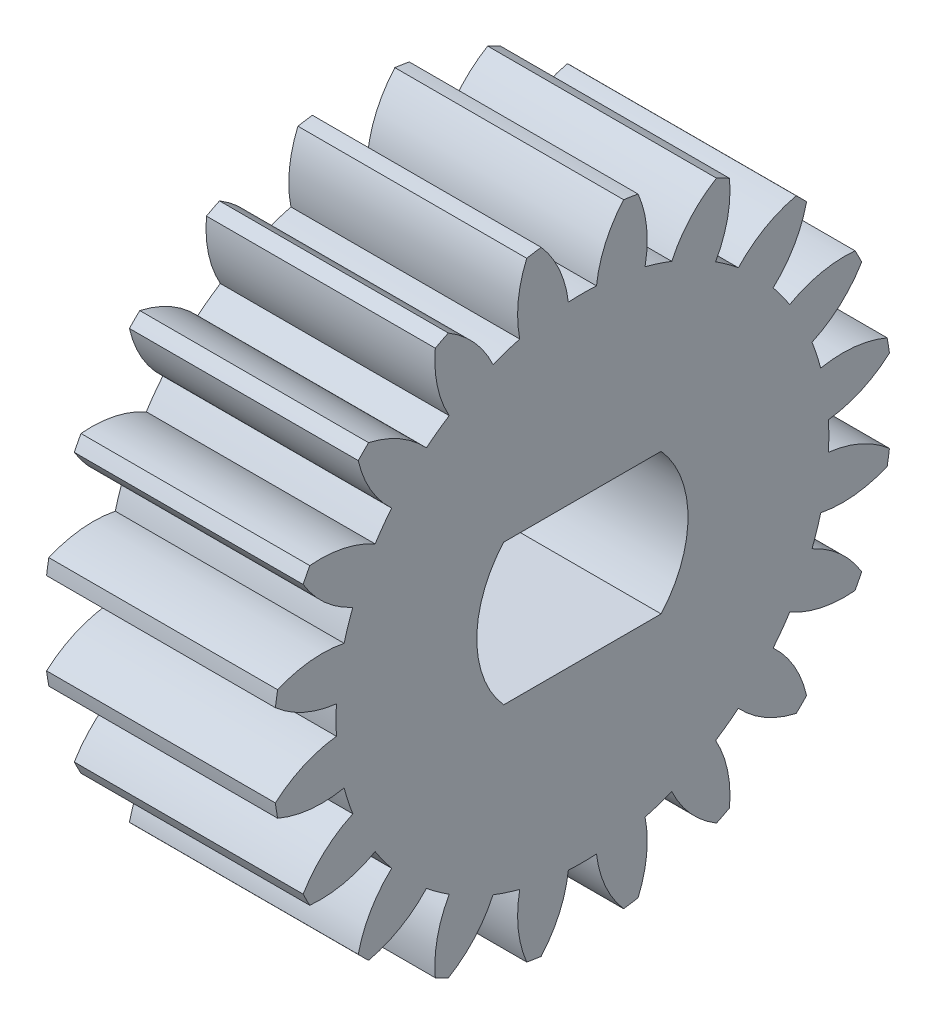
ISO-10303-21;
HEADER;
FILE_DESCRIPTION(('STEP AP214'),'2;1');
FILE_NAME('part.step','',(''),(''),'','','');
FILE_SCHEMA(('AUTOMOTIVE_DESIGN { 1 0 10303 214 1 1 1 1 }'));
ENDSEC;
DATA;
#1=APPLICATION_CONTEXT('core data for automotive mechanical design processes');
#2=APPLICATION_PROTOCOL_DEFINITION('international standard','automotive_design',2000,#1);
#3=PRODUCT_CONTEXT('',#1,'mechanical');
#4=PRODUCT('Part','Part','',(#3));
#5=PRODUCT_RELATED_PRODUCT_CATEGORY('part','',(#4));
#6=PRODUCT_DEFINITION_FORMATION('','',#4);
#7=PRODUCT_DEFINITION_CONTEXT('part definition',#1,'design');
#8=PRODUCT_DEFINITION('design','',#6,#7);
#9=PRODUCT_DEFINITION_SHAPE('','',#8);
#10=(LENGTH_UNIT() NAMED_UNIT(*) SI_UNIT(.MILLI.,.METRE.));
#11=(NAMED_UNIT(*) PLANE_ANGLE_UNIT() SI_UNIT($,.RADIAN.));
#12=(NAMED_UNIT(*) SI_UNIT($,.STERADIAN.) SOLID_ANGLE_UNIT());
#13=UNCERTAINTY_MEASURE_WITH_UNIT(LENGTH_MEASURE(1.E-05),#10,'distance_accuracy_value','');
#14=(GEOMETRIC_REPRESENTATION_CONTEXT(3) GLOBAL_UNCERTAINTY_ASSIGNED_CONTEXT((#13)) GLOBAL_UNIT_ASSIGNED_CONTEXT((#10,
#11,#12)) REPRESENTATION_CONTEXT('',''));
#15=CARTESIAN_POINT('',(0.,0.,0.));
#16=DIRECTION('',(0.,0.,1.));
#17=DIRECTION('',(1.,0.,0.));
#18=AXIS2_PLACEMENT_3D('',#15,#16,#17);
#19=CARTESIAN_POINT('',(6.5,0.,0.));
#20=DIRECTION('',(-1.,0.,0.));
#21=DIRECTION('',(0.,0.,1.));
#22=AXIS2_PLACEMENT_3D('',#19,#20,#21);
#23=PLANE('',#22);
#24=CARTESIAN_POINT('',(6.5,5.1828868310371,-5.4452829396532));
#25=DIRECTION('',(-1.,0.,0.));
#26=DIRECTION('',(0.,-0.309016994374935,-0.951056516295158));
#27=AXIS2_PLACEMENT_3D('',#24,#25,#26);
#28=CIRCLE('',#27,3.2);
#29=CARTESIAN_POINT('',(6.5,6.5222115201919,-2.53904664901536));
#30=VERTEX_POINT('',#29);
#31=CARTESIAN_POINT('',(6.5,7.93292197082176,-3.80903518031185));
#32=VERTEX_POINT('',#31);
#33=EDGE_CURVE('E576',#30,#32,#28,.T.);
#34=ORIENTED_EDGE('',*,*,#33,.F.);
#35=CARTESIAN_POINT('',(6.5,0.,0.));
#36=DIRECTION('',(-1.,0.,0.));
#37=DIRECTION('',(0.,-0.309016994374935,-0.951056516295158));
#38=AXIS2_PLACEMENT_3D('',#35,#36,#37);
#39=CIRCLE('',#38,6.999);
#40=CARTESIAN_POINT('',(6.5,6.7689941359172,-1.77952785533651));
#41=VERTEX_POINT('',#40);
#42=EDGE_CURVE('E580',#41,#30,#39,.T.);
#43=ORIENTED_EDGE('',*,*,#42,.F.);
#44=CARTESIAN_POINT('',(6.5,7.39370053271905,1.35890199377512));
#45=DIRECTION('',(-1.,0.,0.));
#46=DIRECTION('',(0.,-0.309016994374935,-0.951056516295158));
#47=AXIS2_PLACEMENT_3D('',#44,#45,#46);
#48=CIRCLE('',#47,3.2);
#49=CARTESIAN_POINT('',(6.5,8.65676339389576,-1.58128034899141));
#50=VERTEX_POINT('',#49);
#51=EDGE_CURVE('E578',#50,#41,#48,.T.);
#52=ORIENTED_EDGE('',*,*,#51,.F.);
#53=CARTESIAN_POINT('',(6.5,0.,0.));
#54=DIRECTION('',(-1.,0.,0.));
#55=DIRECTION('',(0.,0.,1.));
#56=AXIS2_PLACEMENT_3D('',#53,#54,#55);
#57=CIRCLE('',#56,8.8);
#58=CARTESIAN_POINT('',(6.5,8.72171373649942,-1.17120002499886));
#59=VERTEX_POINT('',#58);
#60=EDGE_CURVE('E1015',#59,#50,#57,.T.);
#61=ORIENTED_EDGE('',*,*,#60,.F.);
#62=CARTESIAN_POINT('',(6.5,6.61190326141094,-3.57717171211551));
#63=DIRECTION('',(-1.,0.,0.));
#64=DIRECTION('',(0.,0.,-1.));
#65=AXIS2_PLACEMENT_3D('',#62,#63,#64);
#66=CIRCLE('',#65,3.2);
#67=CARTESIAN_POINT('',(6.5,6.98760033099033,-0.399302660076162));
#68=VERTEX_POINT('',#67);
#69=EDGE_CURVE('E993',#68,#59,#66,.T.);
#70=ORIENTED_EDGE('',*,*,#69,.F.);
#71=CARTESIAN_POINT('',(6.5,0.,0.));
#72=DIRECTION('',(-1.,0.,0.));
#73=DIRECTION('',(0.,0.,-1.));
#74=AXIS2_PLACEMENT_3D('',#71,#72,#73);
#75=CIRCLE('',#74,6.999);
#76=CARTESIAN_POINT('',(6.5,6.98760033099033,0.399302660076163));
#77=VERTEX_POINT('',#76);
#78=EDGE_CURVE('E997',#77,#68,#75,.T.);
#79=ORIENTED_EDGE('',*,*,#78,.F.);
#80=CARTESIAN_POINT('',(6.5,6.61190326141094,3.57717171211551));
#81=DIRECTION('',(-1.,0.,0.));
#82=DIRECTION('',(0.,0.,-1.));
#83=AXIS2_PLACEMENT_3D('',#80,#81,#82);
#84=CIRCLE('',#83,3.2);
#85=CARTESIAN_POINT('',(6.5,8.72171373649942,1.17120002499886));
#86=VERTEX_POINT('',#85);
#87=EDGE_CURVE('E995',#86,#77,#84,.T.);
#88=ORIENTED_EDGE('',*,*,#87,.F.);
#89=CARTESIAN_POINT('',(6.5,8.65676339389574,1.58128034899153));
#90=VERTEX_POINT('',#89);
#91=EDGE_CURVE('E1013',#90,#86,#57,.T.);
#92=ORIENTED_EDGE('',*,*,#91,.F.);
#93=CARTESIAN_POINT('',(6.5,7.39370053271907,-1.35890199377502));
#94=DIRECTION('',(-1.,0.,0.));
#95=DIRECTION('',(0.,0.309016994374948,-0.951056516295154));
#96=AXIS2_PLACEMENT_3D('',#93,#94,#95);
#97=CIRCLE('',#96,3.2);
#98=CARTESIAN_POINT('',(6.5,6.76899413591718,1.7795278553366));
#99=VERTEX_POINT('',#98);
#100=EDGE_CURVE('E971',#99,#90,#97,.T.);
#101=ORIENTED_EDGE('',*,*,#100,.F.);
#102=CARTESIAN_POINT('',(6.5,0.,0.));
#103=DIRECTION('',(-1.,0.,0.));
#104=DIRECTION('',(0.,0.309016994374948,-0.951056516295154));
#105=AXIS2_PLACEMENT_3D('',#102,#103,#104);
#106=CIRCLE('',#105,6.999);
#107=CARTESIAN_POINT('',(6.5,6.52221152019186,2.53904664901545));
#108=VERTEX_POINT('',#107);
#109=EDGE_CURVE('E975',#108,#99,#106,.T.);
#110=ORIENTED_EDGE('',*,*,#109,.F.);
#111=CARTESIAN_POINT('',(6.5,5.18288683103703,5.44528293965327));
#112=DIRECTION('',(-1.,0.,0.));
#113=DIRECTION('',(0.,0.309016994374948,-0.951056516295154));
#114=AXIS2_PLACEMENT_3D('',#111,#112,#113);
#115=CIRCLE('',#114,3.2);
#116=CARTESIAN_POINT('',(6.5,7.93292197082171,3.80903518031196));
#117=VERTEX_POINT('',#116);
#118=EDGE_CURVE('E973',#117,#108,#115,.T.);
#119=ORIENTED_EDGE('',*,*,#118,.F.);
#120=CARTESIAN_POINT('',(6.5,7.74442873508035,4.17897398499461));
#121=VERTEX_POINT('',#120);
#122=EDGE_CURVE('E1188',#121,#117,#57,.T.);
#123=ORIENTED_EDGE('',*,*,#122,.F.);
#124=CARTESIAN_POINT('',(6.5,7.4517508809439,0.99238651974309));
#125=DIRECTION('',(-1.,0.,0.));
#126=DIRECTION('',(0.,0.587785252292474,-0.809016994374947));
#127=AXIS2_PLACEMENT_3D('',#124,#125,#126);
#128=CIRCLE('',#127,3.2);
#129=CARTESIAN_POINT('',(6.5,5.8877916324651,3.78416578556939));
#130=VERTEX_POINT('',#129);
#131=EDGE_CURVE('E949',#130,#121,#128,.T.);
#132=ORIENTED_EDGE('',*,*,#131,.F.);
#133=CARTESIAN_POINT('',(6.5,0.,0.));
#134=DIRECTION('',(-1.,0.,0.));
#135=DIRECTION('',(0.,0.587785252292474,-0.809016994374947));
#136=AXIS2_PLACEMENT_3D('',#133,#134,#135);
#137=CIRCLE('',#136,6.999);
#138=CARTESIAN_POINT('',(6.5,5.41838320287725,4.43025106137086));
#139=VERTEX_POINT('',#138);
#140=EDGE_CURVE('E953',#139,#130,#137,.T.);
#141=ORIENTED_EDGE('',*,*,#140,.F.);
#142=CARTESIAN_POINT('',(6.5,3.24653332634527,6.78037193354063));
#143=DIRECTION('',(-1.,0.,0.));
#144=DIRECTION('',(0.,0.587785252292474,-0.809016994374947));
#145=AXIS2_PLACEMENT_3D('',#142,#143,#144);
#146=CIRCLE('',#145,3.2);
#147=CARTESIAN_POINT('',(6.5,6.36760053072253,6.07401543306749));
#148=VERTEX_POINT('',#147);
#149=EDGE_CURVE('E951',#148,#139,#146,.T.);
#150=ORIENTED_EDGE('',*,*,#149,.F.);
#151=CARTESIAN_POINT('',(6.5,6.07401543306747,6.36760053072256));
#152=VERTEX_POINT('',#151);
#153=EDGE_CURVE('E1189',#152,#148,#57,.T.);
#154=ORIENTED_EDGE('',*,*,#153,.F.);
#155=CARTESIAN_POINT('',(6.5,6.78037193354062,3.24653332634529));
#156=DIRECTION('',(-1.,0.,0.));
#157=DIRECTION('',(0.,0.809016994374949,-0.587785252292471));
#158=AXIS2_PLACEMENT_3D('',#155,#156,#157);
#159=CIRCLE('',#158,3.2);
#160=CARTESIAN_POINT('',(6.5,4.43025106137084,5.41838320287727));
#161=VERTEX_POINT('',#160);
#162=EDGE_CURVE('E927',#161,#152,#159,.T.);
#163=ORIENTED_EDGE('',*,*,#162,.F.);
#164=CARTESIAN_POINT('',(6.5,0.,0.));
#165=DIRECTION('',(-1.,0.,0.));
#166=DIRECTION('',(0.,0.809016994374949,-0.587785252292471));
#167=AXIS2_PLACEMENT_3D('',#164,#165,#166);
#168=CIRCLE('',#167,6.999);
#169=CARTESIAN_POINT('',(6.5,3.78416578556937,5.88779163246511));
#170=VERTEX_POINT('',#169);
#171=EDGE_CURVE('E931',#170,#161,#168,.T.);
#172=ORIENTED_EDGE('',*,*,#171,.F.);
#173=CARTESIAN_POINT('',(6.5,0.992386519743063,7.45175088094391));
#174=DIRECTION('',(-1.,0.,0.));
#175=DIRECTION('',(0.,0.809016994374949,-0.587785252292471));
#176=AXIS2_PLACEMENT_3D('',#173,#174,#175);
#177=CIRCLE('',#176,3.2);
#178=CARTESIAN_POINT('',(6.5,4.17897398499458,7.74442873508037));
#179=VERTEX_POINT('',#178);
#180=EDGE_CURVE('E929',#179,#170,#177,.T.);
#181=ORIENTED_EDGE('',*,*,#180,.F.);
#182=CARTESIAN_POINT('',(6.5,3.80903518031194,7.93292197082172));
#183=VERTEX_POINT('',#182);
#184=EDGE_CURVE('E1194',#183,#179,#57,.T.);
#185=ORIENTED_EDGE('',*,*,#184,.F.);
#186=CARTESIAN_POINT('',(6.5,5.44528293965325,5.18288683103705));
#187=DIRECTION('',(-1.,0.,0.));
#188=DIRECTION('',(0.,0.951056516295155,-0.309016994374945));
#189=AXIS2_PLACEMENT_3D('',#186,#187,#188);
#190=CIRCLE('',#189,3.2);
#191=CARTESIAN_POINT('',(6.5,2.53904664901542,6.52221152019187));
#192=VERTEX_POINT('',#191);
#193=EDGE_CURVE('E905',#192,#183,#190,.T.);
#194=ORIENTED_EDGE('',*,*,#193,.F.);
#195=CARTESIAN_POINT('',(6.5,0.,0.));
#196=DIRECTION('',(-1.,0.,0.));
#197=DIRECTION('',(0.,0.951056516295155,-0.309016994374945));
#198=AXIS2_PLACEMENT_3D('',#195,#196,#197);
#199=CIRCLE('',#198,6.999);
#200=CARTESIAN_POINT('',(6.5,1.77952785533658,6.76899413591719));
#201=VERTEX_POINT('',#200);
#202=EDGE_CURVE('E909',#201,#192,#199,.T.);
#203=ORIENTED_EDGE('',*,*,#202,.F.);
#204=CARTESIAN_POINT('',(6.5,-1.35890199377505,7.39370053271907));
#205=DIRECTION('',(-1.,0.,0.));
#206=DIRECTION('',(0.,0.951056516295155,-0.309016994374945));
#207=AXIS2_PLACEMENT_3D('',#204,#205,#206);
#208=CIRCLE('',#207,3.2);
#209=CARTESIAN_POINT('',(6.5,1.5812803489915,8.65676339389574));
#210=VERTEX_POINT('',#209);
#211=EDGE_CURVE('E907',#210,#201,#208,.T.);
#212=ORIENTED_EDGE('',*,*,#211,.F.);
#213=CARTESIAN_POINT('',(6.5,1.17120002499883,8.72171373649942));
#214=VERTEX_POINT('',#213);
#215=EDGE_CURVE('E1199',#214,#210,#57,.T.);
#216=ORIENTED_EDGE('',*,*,#215,.F.);
#217=CARTESIAN_POINT('',(6.5,3.57717171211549,6.61190326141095));
#218=DIRECTION('',(-1.,0.,0.));
#219=DIRECTION('',(0.,1.,0.));
#220=AXIS2_PLACEMENT_3D('',#217,#218,#219);
#221=CIRCLE('',#220,3.2);
#222=CARTESIAN_POINT('',(6.5,0.399302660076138,6.98760033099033));
#223=VERTEX_POINT('',#222);
#224=EDGE_CURVE('E883',#223,#214,#221,.T.);
#225=ORIENTED_EDGE('',*,*,#224,.F.);
#226=CARTESIAN_POINT('',(6.5,0.,0.));
#227=DIRECTION('',(-1.,0.,0.));
#228=DIRECTION('',(0.,1.,0.));
#229=AXIS2_PLACEMENT_3D('',#226,#227,#228);
#230=CIRCLE('',#229,6.999);
#231=CARTESIAN_POINT('',(6.5,-0.399302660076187,6.98760033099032));
#232=VERTEX_POINT('',#231);
#233=EDGE_CURVE('E887',#232,#223,#230,.T.);
#234=ORIENTED_EDGE('',*,*,#233,.F.);
#235=CARTESIAN_POINT('',(6.5,-3.57717171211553,6.61190326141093));
#236=DIRECTION('',(-1.,0.,0.));
#237=DIRECTION('',(0.,1.,0.));
#238=AXIS2_PLACEMENT_3D('',#235,#236,#237);
#239=CIRCLE('',#238,3.2);
#240=CARTESIAN_POINT('',(6.5,-1.17120002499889,8.72171373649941));
#241=VERTEX_POINT('',#240);
#242=EDGE_CURVE('E885',#241,#232,#239,.T.);
#243=ORIENTED_EDGE('',*,*,#242,.F.);
#244=CARTESIAN_POINT('',(6.5,-1.58128034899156,8.65676339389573));
#245=VERTEX_POINT('',#244);
#246=EDGE_CURVE('E1204',#245,#241,#57,.T.);
#247=ORIENTED_EDGE('',*,*,#246,.F.);
#248=CARTESIAN_POINT('',(6.5,1.35890199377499,7.39370053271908));
#249=DIRECTION('',(-1.,0.,0.));
#250=DIRECTION('',(0.,0.951056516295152,0.309016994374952));
#251=AXIS2_PLACEMENT_3D('',#248,#249,#250);
#252=CIRCLE('',#251,3.2);
#253=CARTESIAN_POINT('',(6.5,-1.77952785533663,6.76899413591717));
#254=VERTEX_POINT('',#253);
#255=EDGE_CURVE('E861',#254,#245,#252,.T.);
#256=ORIENTED_EDGE('',*,*,#255,.F.);
#257=CARTESIAN_POINT('',(6.5,0.,0.));
#258=DIRECTION('',(-1.,0.,0.));
#259=DIRECTION('',(0.,0.951056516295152,0.309016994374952));
#260=AXIS2_PLACEMENT_3D('',#257,#258,#259);
#261=CIRCLE('',#260,6.999);
#262=CARTESIAN_POINT('',(6.5,-2.53904664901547,6.52221152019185));
#263=VERTEX_POINT('',#262);
#264=EDGE_CURVE('E865',#263,#254,#261,.T.);
#265=ORIENTED_EDGE('',*,*,#264,.F.);
#266=CARTESIAN_POINT('',(6.5,-5.44528293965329,5.18288683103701));
#267=DIRECTION('',(-1.,0.,0.));
#268=DIRECTION('',(0.,0.951056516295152,0.309016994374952));
#269=AXIS2_PLACEMENT_3D('',#266,#267,#268);
#270=CIRCLE('',#269,3.2);
#271=CARTESIAN_POINT('',(6.5,-3.80903518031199,7.93292197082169));
#272=VERTEX_POINT('',#271);
#273=EDGE_CURVE('E863',#272,#263,#270,.T.);
#274=ORIENTED_EDGE('',*,*,#273,.F.);
#275=CARTESIAN_POINT('',(6.5,-4.17897398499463,7.74442873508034));
#276=VERTEX_POINT('',#275);
#277=EDGE_CURVE('E1209',#276,#272,#57,.T.);
#278=ORIENTED_EDGE('',*,*,#277,.F.);
#279=CARTESIAN_POINT('',(6.5,-0.992386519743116,7.4517508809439));
#280=DIRECTION('',(-1.,0.,0.));
#281=DIRECTION('',(0.,0.809016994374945,0.587785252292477));
#282=AXIS2_PLACEMENT_3D('',#279,#280,#281);
#283=CIRCLE('',#282,3.2);
#284=CARTESIAN_POINT('',(6.5,-3.78416578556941,5.88779163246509));
#285=VERTEX_POINT('',#284);
#286=EDGE_CURVE('E839',#285,#276,#283,.T.);
#287=ORIENTED_EDGE('',*,*,#286,.F.);
#288=CARTESIAN_POINT('',(6.5,0.,0.));
#289=DIRECTION('',(-1.,0.,0.));
#290=DIRECTION('',(0.,0.809016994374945,0.587785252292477));
#291=AXIS2_PLACEMENT_3D('',#288,#289,#290);
#292=CIRCLE('',#291,6.999);
#293=CARTESIAN_POINT('',(6.5,-4.43025106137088,5.41838320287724));
#294=VERTEX_POINT('',#293);
#295=EDGE_CURVE('E843',#294,#285,#292,.T.);
#296=ORIENTED_EDGE('',*,*,#295,.F.);
#297=CARTESIAN_POINT('',(6.5,-6.78037193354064,3.24653332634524));
#298=DIRECTION('',(-1.,0.,0.));
#299=DIRECTION('',(0.,0.809016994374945,0.587785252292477));
#300=AXIS2_PLACEMENT_3D('',#297,#298,#299);
#301=CIRCLE('',#300,3.2);
#302=CARTESIAN_POINT('',(6.5,-6.07401543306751,6.36760053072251));
#303=VERTEX_POINT('',#302);
#304=EDGE_CURVE('E841',#303,#294,#301,.T.);
#305=ORIENTED_EDGE('',*,*,#304,.F.);
#306=CARTESIAN_POINT('',(6.5,-6.36760053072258,6.07401543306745));
#307=VERTEX_POINT('',#306);
#308=EDGE_CURVE('E1214',#307,#303,#57,.T.);
#309=ORIENTED_EDGE('',*,*,#308,.F.);
#310=CARTESIAN_POINT('',(6.5,-3.24653332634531,6.78037193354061));
#311=DIRECTION('',(-1.,0.,0.));
#312=DIRECTION('',(0.,0.587785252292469,0.809016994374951));
#313=AXIS2_PLACEMENT_3D('',#310,#311,#312);
#314=CIRCLE('',#313,3.2);
#315=CARTESIAN_POINT('',(6.5,-5.41838320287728,4.43025106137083));
#316=VERTEX_POINT('',#315);
#317=EDGE_CURVE('E817',#316,#307,#314,.T.);
#318=ORIENTED_EDGE('',*,*,#317,.F.);
#319=CARTESIAN_POINT('',(6.5,0.,0.));
#320=DIRECTION('',(-1.,0.,0.));
#321=DIRECTION('',(0.,0.587785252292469,0.809016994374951));
#322=AXIS2_PLACEMENT_3D('',#319,#320,#321);
#323=CIRCLE('',#322,6.999);
#324=CARTESIAN_POINT('',(6.5,-5.88779163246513,3.78416578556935));
#325=VERTEX_POINT('',#324);
#326=EDGE_CURVE('E821',#325,#316,#323,.T.);
#327=ORIENTED_EDGE('',*,*,#326,.F.);
#328=CARTESIAN_POINT('',(6.5,-7.45175088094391,0.992386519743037));
#329=DIRECTION('',(-1.,0.,0.));
#330=DIRECTION('',(0.,0.587785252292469,0.809016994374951));
#331=AXIS2_PLACEMENT_3D('',#328,#329,#330);
#332=CIRCLE('',#331,3.2);
#333=CARTESIAN_POINT('',(6.5,-7.74442873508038,4.17897398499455));
#334=VERTEX_POINT('',#333);
#335=EDGE_CURVE('E819',#334,#325,#332,.T.);
#336=ORIENTED_EDGE('',*,*,#335,.F.);
#337=CARTESIAN_POINT('',(6.5,-7.93292197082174,3.80903518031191));
#338=VERTEX_POINT('',#337);
#339=EDGE_CURVE('E1219',#338,#334,#57,.T.);
#340=ORIENTED_EDGE('',*,*,#339,.F.);
#341=CARTESIAN_POINT('',(6.5,-5.18288683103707,5.44528293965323));
#342=DIRECTION('',(-1.,0.,0.));
#343=DIRECTION('',(0.,0.309016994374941,0.951056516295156));
#344=AXIS2_PLACEMENT_3D('',#341,#342,#343);
#345=CIRCLE('',#344,3.2);
#346=CARTESIAN_POINT('',(6.5,-6.52221152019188,2.5390466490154));
#347=VERTEX_POINT('',#346);
#348=EDGE_CURVE('E795',#347,#338,#345,.T.);
#349=ORIENTED_EDGE('',*,*,#348,.F.);
#350=CARTESIAN_POINT('',(6.5,0.,0.));
#351=DIRECTION('',(-1.,0.,0.));
#352=DIRECTION('',(0.,0.309016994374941,0.951056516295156));
#353=AXIS2_PLACEMENT_3D('',#350,#351,#352);
#354=CIRCLE('',#353,6.999);
#355=CARTESIAN_POINT('',(6.5,-6.76899413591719,1.77952785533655));
#356=VERTEX_POINT('',#355);
#357=EDGE_CURVE('E799',#356,#347,#354,.T.);
#358=ORIENTED_EDGE('',*,*,#357,.F.);
#359=CARTESIAN_POINT('',(6.5,-7.39370053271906,-1.35890199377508));
#360=DIRECTION('',(-1.,0.,0.));
#361=DIRECTION('',(0.,0.309016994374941,0.951056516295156));
#362=AXIS2_PLACEMENT_3D('',#359,#360,#361);
#363=CIRCLE('',#362,3.2);
#364=CARTESIAN_POINT('',(6.5,-8.65676339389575,1.58128034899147));
#365=VERTEX_POINT('',#364);
#366=EDGE_CURVE('E797',#365,#356,#363,.T.);
#367=ORIENTED_EDGE('',*,*,#366,.F.);
#368=CARTESIAN_POINT('',(6.5,-8.72171373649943,1.1712000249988));
#369=VERTEX_POINT('',#368);
#370=EDGE_CURVE('E1224',#369,#365,#57,.T.);
#371=ORIENTED_EDGE('',*,*,#370,.F.);
#372=CARTESIAN_POINT('',(6.5,-6.61190326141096,3.57717171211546));
#373=DIRECTION('',(-1.,0.,0.));
#374=DIRECTION('',(0.,0.,1.));
#375=AXIS2_PLACEMENT_3D('',#372,#373,#374);
#376=CIRCLE('',#375,3.2);
#377=CARTESIAN_POINT('',(6.5,-6.98760033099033,0.399302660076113));
#378=VERTEX_POINT('',#377);
#379=EDGE_CURVE('E773',#378,#369,#376,.T.);
#380=ORIENTED_EDGE('',*,*,#379,.F.);
#381=CARTESIAN_POINT('',(6.5,0.,0.));
#382=DIRECTION('',(-1.,0.,0.));
#383=DIRECTION('',(0.,0.,1.));
#384=AXIS2_PLACEMENT_3D('',#381,#382,#383);
#385=CIRCLE('',#384,6.999);
#386=CARTESIAN_POINT('',(6.5,-6.98760033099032,-0.399302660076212));
#387=VERTEX_POINT('',#386);
#388=EDGE_CURVE('E777',#387,#378,#385,.T.);
#389=ORIENTED_EDGE('',*,*,#388,.F.);
#390=CARTESIAN_POINT('',(6.5,-6.61190326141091,-3.57717171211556));
#391=DIRECTION('',(-1.,0.,0.));
#392=DIRECTION('',(0.,0.,1.));
#393=AXIS2_PLACEMENT_3D('',#390,#391,#392);
#394=CIRCLE('',#393,3.2);
#395=CARTESIAN_POINT('',(6.5,-8.72171373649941,-1.17120002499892));
#396=VERTEX_POINT('',#395);
#397=EDGE_CURVE('E775',#396,#387,#394,.T.);
#398=ORIENTED_EDGE('',*,*,#397,.F.);
#399=CARTESIAN_POINT('',(6.5,-8.65676339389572,-1.58128034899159));
#400=VERTEX_POINT('',#399);
#401=EDGE_CURVE('E1229',#400,#396,#57,.T.);
#402=ORIENTED_EDGE('',*,*,#401,.F.);
#403=CARTESIAN_POINT('',(6.5,-7.39370053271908,1.35890199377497));
#404=DIRECTION('',(-1.,0.,0.));
#405=DIRECTION('',(0.,-0.309016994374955,0.951056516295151));
#406=AXIS2_PLACEMENT_3D('',#403,#404,#405);
#407=CIRCLE('',#406,3.2);
#408=CARTESIAN_POINT('',(6.5,-6.76899413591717,-1.77952785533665));
#409=VERTEX_POINT('',#408);
#410=EDGE_CURVE('E751',#409,#400,#407,.T.);
#411=ORIENTED_EDGE('',*,*,#410,.F.);
#412=CARTESIAN_POINT('',(6.5,0.,0.));
#413=DIRECTION('',(-1.,0.,0.));
#414=DIRECTION('',(0.,-0.309016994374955,0.951056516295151));
#415=AXIS2_PLACEMENT_3D('',#412,#413,#414);
#416=CIRCLE('',#415,6.999);
#417=CARTESIAN_POINT('',(6.5,-6.52221152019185,-2.53904664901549));
#418=VERTEX_POINT('',#417);
#419=EDGE_CURVE('E755',#418,#409,#416,.T.);
#420=ORIENTED_EDGE('',*,*,#419,.F.);
#421=CARTESIAN_POINT('',(6.5,-5.18288683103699,-5.44528293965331));
#422=DIRECTION('',(-1.,0.,0.));
#423=DIRECTION('',(0.,-0.309016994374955,0.951056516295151));
#424=AXIS2_PLACEMENT_3D('',#421,#422,#423);
#425=CIRCLE('',#424,3.2);
#426=CARTESIAN_POINT('',(6.5,-7.93292197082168,-3.80903518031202));
#427=VERTEX_POINT('',#426);
#428=EDGE_CURVE('E753',#427,#418,#425,.T.);
#429=ORIENTED_EDGE('',*,*,#428,.F.);
#430=CARTESIAN_POINT('',(6.5,-7.74442873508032,-4.17897398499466));
#431=VERTEX_POINT('',#430);
#432=EDGE_CURVE('E1234',#431,#427,#57,.T.);
#433=ORIENTED_EDGE('',*,*,#432,.F.);
#434=CARTESIAN_POINT('',(6.5,-7.45175088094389,-0.992386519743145));
#435=DIRECTION('',(-1.,0.,0.));
#436=DIRECTION('',(0.,-0.58778525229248,0.809016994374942));
#437=AXIS2_PLACEMENT_3D('',#434,#435,#436);
#438=CIRCLE('',#437,3.2);
#439=CARTESIAN_POINT('',(6.5,-5.88779163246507,-3.78416578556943));
#440=VERTEX_POINT('',#439);
#441=EDGE_CURVE('E729',#440,#431,#438,.T.);
#442=ORIENTED_EDGE('',*,*,#441,.F.);
#443=CARTESIAN_POINT('',(6.5,0.,0.));
#444=DIRECTION('',(-1.,0.,0.));
#445=DIRECTION('',(0.,-0.58778525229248,0.809016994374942));
#446=AXIS2_PLACEMENT_3D('',#443,#444,#445);
#447=CIRCLE('',#446,6.999);
#448=CARTESIAN_POINT('',(6.5,-5.41838320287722,-4.4302510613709));
#449=VERTEX_POINT('',#448);
#450=EDGE_CURVE('E733',#449,#440,#447,.T.);
#451=ORIENTED_EDGE('',*,*,#450,.F.);
#452=CARTESIAN_POINT('',(6.5,-3.24653332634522,-6.78037193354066));
#453=DIRECTION('',(-1.,0.,0.));
#454=DIRECTION('',(0.,-0.58778525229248,0.809016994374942));
#455=AXIS2_PLACEMENT_3D('',#452,#453,#454);
#456=CIRCLE('',#455,3.2);
#457=CARTESIAN_POINT('',(6.5,-6.36760053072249,-6.07401543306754));
#458=VERTEX_POINT('',#457);
#459=EDGE_CURVE('E731',#458,#449,#456,.T.);
#460=ORIENTED_EDGE('',*,*,#459,.F.);
#461=CARTESIAN_POINT('',(6.5,-6.07401543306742,-6.3676005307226));
#462=VERTEX_POINT('',#461);
#463=EDGE_CURVE('E1239',#462,#458,#57,.T.);
#464=ORIENTED_EDGE('',*,*,#463,.F.);
#465=CARTESIAN_POINT('',(6.5,-6.7803719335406,-3.24653332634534));
#466=DIRECTION('',(-1.,0.,0.));
#467=DIRECTION('',(0.,-0.809016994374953,0.587785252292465));
#468=AXIS2_PLACEMENT_3D('',#465,#466,#467);
#469=CIRCLE('',#468,3.2);
#470=CARTESIAN_POINT('',(6.5,-4.4302510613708,-5.4183832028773));
#471=VERTEX_POINT('',#470);
#472=EDGE_CURVE('E707',#471,#462,#469,.T.);
#473=ORIENTED_EDGE('',*,*,#472,.F.);
#474=CARTESIAN_POINT('',(6.5,0.,0.));
#475=DIRECTION('',(-1.,0.,0.));
#476=DIRECTION('',(0.,-0.809016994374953,0.587785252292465));
#477=AXIS2_PLACEMENT_3D('',#474,#475,#476);
#478=CIRCLE('',#477,6.999);
#479=CARTESIAN_POINT('',(6.5,-3.78416578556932,-5.88779163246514));
#480=VERTEX_POINT('',#479);
#481=EDGE_CURVE('E711',#480,#471,#478,.T.);
#482=ORIENTED_EDGE('',*,*,#481,.F.);
#483=CARTESIAN_POINT('',(6.5,-0.992386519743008,-7.45175088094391));
#484=DIRECTION('',(-1.,0.,0.));
#485=DIRECTION('',(0.,-0.809016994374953,0.587785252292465));
#486=AXIS2_PLACEMENT_3D('',#483,#484,#485);
#487=CIRCLE('',#486,3.2);
#488=CARTESIAN_POINT('',(6.5,-4.17897398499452,-7.7444287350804));
#489=VERTEX_POINT('',#488);
#490=EDGE_CURVE('E709',#489,#480,#487,.T.);
#491=ORIENTED_EDGE('',*,*,#490,.F.);
#492=CARTESIAN_POINT('',(6.5,-3.80903518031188,-7.93292197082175));
#493=VERTEX_POINT('',#492);
#494=EDGE_CURVE('E1244',#493,#489,#57,.T.);
#495=ORIENTED_EDGE('',*,*,#494,.F.);
#496=CARTESIAN_POINT('',(6.5,-5.44528293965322,-5.18288683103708));
#497=DIRECTION('',(-1.,0.,0.));
#498=DIRECTION('',(0.,-0.951056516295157,0.309016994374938));
#499=AXIS2_PLACEMENT_3D('',#496,#497,#498);
#500=CIRCLE('',#499,3.2);
#501=CARTESIAN_POINT('',(6.5,-2.53904664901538,-6.52221152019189));
#502=VERTEX_POINT('',#501);
#503=EDGE_CURVE('E685',#502,#493,#500,.T.);
#504=ORIENTED_EDGE('',*,*,#503,.F.);
#505=CARTESIAN_POINT('',(6.5,0.,0.));
#506=DIRECTION('',(-1.,0.,0.));
#507=DIRECTION('',(0.,-0.951056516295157,0.309016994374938));
#508=AXIS2_PLACEMENT_3D('',#505,#506,#507);
#509=CIRCLE('',#508,6.999);
#510=CARTESIAN_POINT('',(6.5,-1.77952785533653,-6.7689941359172));
#511=VERTEX_POINT('',#510);
#512=EDGE_CURVE('E689',#511,#502,#509,.T.);
#513=ORIENTED_EDGE('',*,*,#512,.F.);
#514=CARTESIAN_POINT('',(6.5,1.3589019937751,-7.39370053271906));
#515=DIRECTION('',(-1.,0.,0.));
#516=DIRECTION('',(0.,-0.951056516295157,0.309016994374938));
#517=AXIS2_PLACEMENT_3D('',#514,#515,#516);
#518=CIRCLE('',#517,3.2);
#519=CARTESIAN_POINT('',(6.5,-1.58128034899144,-8.65676339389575));
#520=VERTEX_POINT('',#519);
#521=EDGE_CURVE('E687',#520,#511,#518,.T.);
#522=ORIENTED_EDGE('',*,*,#521,.F.);
#523=CARTESIAN_POINT('',(6.5,-1.17120002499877,-8.72171373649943));
#524=VERTEX_POINT('',#523);
#525=EDGE_CURVE('E1249',#524,#520,#57,.T.);
#526=ORIENTED_EDGE('',*,*,#525,.F.);
#527=CARTESIAN_POINT('',(6.5,-3.57717171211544,-6.61190326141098));
#528=DIRECTION('',(-1.,0.,0.));
#529=DIRECTION('',(0.,-1.,0.));
#530=AXIS2_PLACEMENT_3D('',#527,#528,#529);
#531=CIRCLE('',#530,3.2);
#532=CARTESIAN_POINT('',(6.5,-0.399302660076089,-6.98760033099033));
#533=VERTEX_POINT('',#532);
#534=EDGE_CURVE('E663',#533,#524,#531,.T.);
#535=ORIENTED_EDGE('',*,*,#534,.F.);
#536=CARTESIAN_POINT('',(6.5,0.,0.));
#537=DIRECTION('',(-1.,0.,0.));
#538=DIRECTION('',(0.,-1.,0.));
#539=AXIS2_PLACEMENT_3D('',#536,#537,#538);
#540=CIRCLE('',#539,6.999);
#541=CARTESIAN_POINT('',(6.5,0.399302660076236,-6.98760033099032));
#542=VERTEX_POINT('',#541);
#543=EDGE_CURVE('E667',#542,#533,#540,.T.);
#544=ORIENTED_EDGE('',*,*,#543,.F.);
#545=CARTESIAN_POINT('',(6.5,3.57717171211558,-6.6119032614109));
#546=DIRECTION('',(-1.,0.,0.));
#547=DIRECTION('',(0.,-1.,0.));
#548=AXIS2_PLACEMENT_3D('',#545,#546,#547);
#549=CIRCLE('',#548,3.2);
#550=CARTESIAN_POINT('',(6.5,1.17120002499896,-8.7217137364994));
#551=VERTEX_POINT('',#550);
#552=EDGE_CURVE('E665',#551,#542,#549,.T.);
#553=ORIENTED_EDGE('',*,*,#552,.F.);
#554=CARTESIAN_POINT('',(6.5,1.58128034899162,-8.65676339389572));
#555=VERTEX_POINT('',#554);
#556=EDGE_CURVE('E1254',#555,#551,#57,.T.);
#557=ORIENTED_EDGE('',*,*,#556,.F.);
#558=CARTESIAN_POINT('',(6.5,-1.35890199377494,-7.39370053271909));
#559=DIRECTION('',(-1.,0.,0.));
#560=DIRECTION('',(0.,-0.95105651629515,-0.309016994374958));
#561=AXIS2_PLACEMENT_3D('',#558,#559,#560);
#562=CIRCLE('',#561,3.2);
#563=CARTESIAN_POINT('',(6.5,1.77952785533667,-6.76899413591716));
#564=VERTEX_POINT('',#563);
#565=EDGE_CURVE('E641',#564,#555,#562,.T.);
#566=ORIENTED_EDGE('',*,*,#565,.F.);
#567=CARTESIAN_POINT('',(6.5,0.,0.));
#568=DIRECTION('',(-1.,0.,0.));
#569=DIRECTION('',(0.,-0.95105651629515,-0.309016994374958));
#570=AXIS2_PLACEMENT_3D('',#567,#568,#569);
#571=CIRCLE('',#570,6.999);
#572=CARTESIAN_POINT('',(6.5,2.53904664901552,-6.52221152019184));
#573=VERTEX_POINT('',#572);
#574=EDGE_CURVE('E645',#573,#564,#571,.T.);
#575=ORIENTED_EDGE('',*,*,#574,.F.);
#576=CARTESIAN_POINT('',(6.5,5.44528293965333,-5.18288683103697));
#577=DIRECTION('',(-1.,0.,0.));
#578=DIRECTION('',(0.,-0.95105651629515,-0.309016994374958));
#579=AXIS2_PLACEMENT_3D('',#576,#577,#578);
#580=CIRCLE('',#579,3.2);
#581=CARTESIAN_POINT('',(6.5,3.80903518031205,-7.93292197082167));
#582=VERTEX_POINT('',#581);
#583=EDGE_CURVE('E643',#582,#573,#580,.T.);
#584=ORIENTED_EDGE('',*,*,#583,.F.);
#585=CARTESIAN_POINT('',(6.5,4.17897398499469,-7.74442873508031));
#586=VERTEX_POINT('',#585);
#587=EDGE_CURVE('E1259',#586,#582,#57,.T.);
#588=ORIENTED_EDGE('',*,*,#587,.F.);
#589=CARTESIAN_POINT('',(6.5,0.99238651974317,-7.45175088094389));
#590=DIRECTION('',(-1.,0.,0.));
#591=DIRECTION('',(0.,-0.80901699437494,-0.587785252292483));
#592=AXIS2_PLACEMENT_3D('',#589,#590,#591);
#593=CIRCLE('',#592,3.2);
#594=CARTESIAN_POINT('',(6.5,3.78416578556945,-5.88779163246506));
#595=VERTEX_POINT('',#594);
#596=EDGE_CURVE('E619',#595,#586,#593,.T.);
#597=ORIENTED_EDGE('',*,*,#596,.F.);
#598=CARTESIAN_POINT('',(6.5,0.,0.));
#599=DIRECTION('',(-1.,0.,0.));
#600=DIRECTION('',(0.,-0.80901699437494,-0.587785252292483));
#601=AXIS2_PLACEMENT_3D('',#598,#599,#600);
#602=CIRCLE('',#601,6.999);
#603=CARTESIAN_POINT('',(6.5,4.43025106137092,-5.4183832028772));
#604=VERTEX_POINT('',#603);
#605=EDGE_CURVE('E623',#604,#595,#602,.T.);
#606=ORIENTED_EDGE('',*,*,#605,.F.);
#607=CARTESIAN_POINT('',(6.5,6.78037193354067,-3.24653332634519));
#608=DIRECTION('',(-1.,0.,0.));
#609=DIRECTION('',(0.,-0.80901699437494,-0.587785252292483));
#610=AXIS2_PLACEMENT_3D('',#607,#608,#609);
#611=CIRCLE('',#610,3.2);
#612=CARTESIAN_POINT('',(6.5,6.07401543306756,-6.36760053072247));
#613=VERTEX_POINT('',#612);
#614=EDGE_CURVE('E621',#613,#604,#611,.T.);
#615=ORIENTED_EDGE('',*,*,#614,.F.);
#616=CARTESIAN_POINT('',(6.5,6.36760053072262,-6.0740154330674));
#617=VERTEX_POINT('',#616);
#618=EDGE_CURVE('E1264',#617,#613,#57,.T.);
#619=ORIENTED_EDGE('',*,*,#618,.F.);
#620=CARTESIAN_POINT('',(6.5,3.24653332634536,-6.78037193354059));
#621=DIRECTION('',(-1.,0.,0.));
#622=DIRECTION('',(0.,-0.587785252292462,-0.809016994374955));
#623=AXIS2_PLACEMENT_3D('',#620,#621,#622);
#624=CIRCLE('',#623,3.2);
#625=CARTESIAN_POINT('',(6.5,5.41838320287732,-4.43025106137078));
#626=VERTEX_POINT('',#625);
#627=EDGE_CURVE('E597',#626,#617,#624,.T.);
#628=ORIENTED_EDGE('',*,*,#627,.F.);
#629=CARTESIAN_POINT('',(6.5,0.,0.));
#630=DIRECTION('',(-1.,0.,0.));
#631=DIRECTION('',(0.,-0.587785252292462,-0.809016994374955));
#632=AXIS2_PLACEMENT_3D('',#629,#630,#631);
#633=CIRCLE('',#632,6.999);
#634=CARTESIAN_POINT('',(6.5,5.88779163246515,-3.7841657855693));
#635=VERTEX_POINT('',#634);
#636=EDGE_CURVE('E601',#635,#626,#633,.T.);
#637=ORIENTED_EDGE('',*,*,#636,.F.);
#638=CARTESIAN_POINT('',(6.5,7.45175088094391,-0.992386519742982));
#639=DIRECTION('',(-1.,0.,0.));
#640=DIRECTION('',(0.,-0.587785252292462,-0.809016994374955));
#641=AXIS2_PLACEMENT_3D('',#638,#639,#640);
#642=CIRCLE('',#641,3.2);
#643=CARTESIAN_POINT('',(6.5,7.74442873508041,-4.17897398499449));
#644=VERTEX_POINT('',#643);
#645=EDGE_CURVE('E599',#644,#635,#642,.T.);
#646=ORIENTED_EDGE('',*,*,#645,.F.);
#647=EDGE_CURVE('E1019',#32,#644,#57,.T.);
#648=ORIENTED_EDGE('',*,*,#647,.F.);
#649=EDGE_LOOP('',(#34,#43,#52,#61,#70,#79,#88,#92,#101,#110,#119,#123,#132,#141,#150,#154,#163,
#172,#181,#185,#194,#203,#212,#216,#225,#234,#243,#247,#256,#265,#274,#278,#287,#296,#305,#309,
#318,#327,#336,#340,#349,#358,#367,#371,#380,#389,#398,#402,#411,#420,#429,#433,#442,#451,#460,
#464,#473,#482,#491,#495,#504,#513,#522,#526,#535,#544,#553,#557,#566,#575,#584,#588,#597,#606,
#615,#619,#628,#637,#646,#648));
#650=FACE_BOUND('',#649,.T.);
#651=CARTESIAN_POINT('',(6.5,0.,0.));
#652=DIRECTION('',(-1.,0.,0.));
#653=DIRECTION('',(0.,0.,1.));
#654=AXIS2_PLACEMENT_3D('',#651,#652,#653);
#655=CIRCLE('',#654,3.);
#656=CARTESIAN_POINT('',(6.5,-2.,-2.23606797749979));
#657=VERTEX_POINT('',#656);
#658=CARTESIAN_POINT('',(6.5,2.,-2.23606797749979));
#659=VERTEX_POINT('',#658);
#660=EDGE_CURVE('E559',#657,#659,#655,.F.);
#661=ORIENTED_EDGE('',*,*,#660,.F.);
#662=DIRECTION('',(0.,0.,-1.));
#663=VECTOR('',#662,1.);
#664=CARTESIAN_POINT('',(6.5,-2.,0.));
#665=LINE('',#664,#663);
#666=CARTESIAN_POINT('',(6.5,-2.,2.23606797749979));
#667=VERTEX_POINT('',#666);
#668=EDGE_CURVE('E548',#667,#657,#665,.T.);
#669=ORIENTED_EDGE('',*,*,#668,.F.);
#670=CARTESIAN_POINT('',(6.5,0.,0.));
#671=DIRECTION('',(-1.,0.,0.));
#672=DIRECTION('',(0.,0.,1.));
#673=AXIS2_PLACEMENT_3D('',#670,#671,#672);
#674=CIRCLE('',#673,3.);
#675=CARTESIAN_POINT('',(6.5,2.,2.23606797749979));
#676=VERTEX_POINT('',#675);
#677=EDGE_CURVE('E553',#676,#667,#674,.F.);
#678=ORIENTED_EDGE('',*,*,#677,.F.);
#679=DIRECTION('',(0.,0.,1.));
#680=VECTOR('',#679,1.);
#681=CARTESIAN_POINT('',(6.5,2.,0.));
#682=LINE('',#681,#680);
#683=EDGE_CURVE('E565',#659,#676,#682,.T.);
#684=ORIENTED_EDGE('',*,*,#683,.F.);
#685=EDGE_LOOP('',(#661,#669,#678,#684));
#686=FACE_BOUND('',#685,.T.);
#687=ADVANCED_FACE('F32',(#650,#686),#23,.F.);
#688=CARTESIAN_POINT('',(0.,0.,0.));
#689=DIRECTION('',(1.,0.,0.));
#690=DIRECTION('',(0.,0.,-1.));
#691=AXIS2_PLACEMENT_3D('',#688,#689,#690);
#692=PLANE('',#691);
#693=CARTESIAN_POINT('',(0.,5.1828868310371,-5.4452829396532));
#694=DIRECTION('',(-1.,0.,0.));
#695=DIRECTION('',(0.,-0.309016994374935,-0.951056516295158));
#696=AXIS2_PLACEMENT_3D('',#693,#694,#695);
#697=CIRCLE('',#696,3.2);
#698=CARTESIAN_POINT('',(0.,6.5222115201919,-2.53904664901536));
#699=VERTEX_POINT('',#698);
#700=CARTESIAN_POINT('',(0.,7.93292197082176,-3.80903518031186));
#701=VERTEX_POINT('',#700);
#702=EDGE_CURVE('E566',#699,#701,#697,.T.);
#703=ORIENTED_EDGE('',*,*,#702,.T.);
#704=CARTESIAN_POINT('',(0.,0.,0.));
#705=DIRECTION('',(-1.,0.,0.));
#706=DIRECTION('',(0.,0.,1.));
#707=AXIS2_PLACEMENT_3D('',#704,#705,#706);
#708=CIRCLE('',#707,8.8);
#709=CARTESIAN_POINT('',(0.,7.74442873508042,-4.17897398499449));
#710=VERTEX_POINT('',#709);
#711=EDGE_CURVE('E1014',#701,#710,#708,.T.);
#712=ORIENTED_EDGE('',*,*,#711,.T.);
#713=CARTESIAN_POINT('',(0.,7.45175088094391,-0.992386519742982));
#714=DIRECTION('',(1.,0.,0.));
#715=DIRECTION('',(0.,0.,-1.));
#716=AXIS2_PLACEMENT_3D('',#713,#714,#715);
#717=CIRCLE('',#716,3.2);
#718=CARTESIAN_POINT('',(0.,5.88779163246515,-3.7841657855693));
#719=VERTEX_POINT('',#718);
#720=EDGE_CURVE('E1073',#719,#710,#717,.T.);
#721=ORIENTED_EDGE('',*,*,#720,.F.);
#722=CARTESIAN_POINT('',(0.,0.,0.));
#723=DIRECTION('',(-1.,0.,0.));
#724=DIRECTION('',(0.,-0.587785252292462,-0.809016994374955));
#725=AXIS2_PLACEMENT_3D('',#722,#723,#724);
#726=CIRCLE('',#725,6.999);
#727=CARTESIAN_POINT('',(0.,5.41838320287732,-4.43025106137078));
#728=VERTEX_POINT('',#727);
#729=EDGE_CURVE('E594',#719,#728,#726,.T.);
#730=ORIENTED_EDGE('',*,*,#729,.T.);
#731=CARTESIAN_POINT('',(0.,3.24653332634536,-6.78037193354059));
#732=DIRECTION('',(-1.,0.,0.));
#733=DIRECTION('',(0.,-0.587785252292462,-0.809016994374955));
#734=AXIS2_PLACEMENT_3D('',#731,#732,#733);
#735=CIRCLE('',#734,3.2);
#736=CARTESIAN_POINT('',(0.,6.36760053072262,-6.0740154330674));
#737=VERTEX_POINT('',#736);
#738=EDGE_CURVE('E591',#728,#737,#735,.T.);
#739=ORIENTED_EDGE('',*,*,#738,.T.);
#740=CARTESIAN_POINT('',(0.,6.07401543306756,-6.36760053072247));
#741=VERTEX_POINT('',#740);
#742=EDGE_CURVE('E1124',#737,#741,#708,.T.);
#743=ORIENTED_EDGE('',*,*,#742,.T.);
#744=CARTESIAN_POINT('',(0.,6.78037193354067,-3.24653332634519));
#745=DIRECTION('',(1.,0.,0.));
#746=DIRECTION('',(0.,0.,-1.));
#747=AXIS2_PLACEMENT_3D('',#744,#745,#746);
#748=CIRCLE('',#747,3.2);
#749=CARTESIAN_POINT('',(0.,4.43025106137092,-5.4183832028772));
#750=VERTEX_POINT('',#749);
#751=EDGE_CURVE('E1070',#750,#741,#748,.T.);
#752=ORIENTED_EDGE('',*,*,#751,.F.);
#753=CARTESIAN_POINT('',(0.,0.,0.));
#754=DIRECTION('',(-1.,0.,0.));
#755=DIRECTION('',(0.,-0.80901699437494,-0.587785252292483));
#756=AXIS2_PLACEMENT_3D('',#753,#754,#755);
#757=CIRCLE('',#756,6.999);
#758=CARTESIAN_POINT('',(0.,3.78416578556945,-5.88779163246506));
#759=VERTEX_POINT('',#758);
#760=EDGE_CURVE('E616',#750,#759,#757,.T.);
#761=ORIENTED_EDGE('',*,*,#760,.T.);
#762=CARTESIAN_POINT('',(0.,0.99238651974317,-7.45175088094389));
#763=DIRECTION('',(-1.,0.,0.));
#764=DIRECTION('',(0.,-0.80901699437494,-0.587785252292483));
#765=AXIS2_PLACEMENT_3D('',#762,#763,#764);
#766=CIRCLE('',#765,3.2);
#767=CARTESIAN_POINT('',(0.,4.17897398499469,-7.74442873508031));
#768=VERTEX_POINT('',#767);
#769=EDGE_CURVE('E613',#759,#768,#766,.T.);
#770=ORIENTED_EDGE('',*,*,#769,.T.);
#771=CARTESIAN_POINT('',(0.,3.80903518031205,-7.93292197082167));
#772=VERTEX_POINT('',#771);
#773=EDGE_CURVE('E1125',#768,#772,#708,.T.);
#774=ORIENTED_EDGE('',*,*,#773,.T.);
#775=CARTESIAN_POINT('',(0.,5.44528293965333,-5.18288683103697));
#776=DIRECTION('',(1.,0.,0.));
#777=DIRECTION('',(0.,0.,-1.));
#778=AXIS2_PLACEMENT_3D('',#775,#776,#777);
#779=CIRCLE('',#778,3.2);
#780=CARTESIAN_POINT('',(0.,2.53904664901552,-6.52221152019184));
#781=VERTEX_POINT('',#780);
#782=EDGE_CURVE('E1067',#781,#772,#779,.T.);
#783=ORIENTED_EDGE('',*,*,#782,.F.);
#784=CARTESIAN_POINT('',(0.,0.,0.));
#785=DIRECTION('',(-1.,0.,0.));
#786=DIRECTION('',(0.,-0.95105651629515,-0.309016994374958));
#787=AXIS2_PLACEMENT_3D('',#784,#785,#786);
#788=CIRCLE('',#787,6.999);
#789=CARTESIAN_POINT('',(0.,1.77952785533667,-6.76899413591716));
#790=VERTEX_POINT('',#789);
#791=EDGE_CURVE('E638',#781,#790,#788,.T.);
#792=ORIENTED_EDGE('',*,*,#791,.T.);
#793=CARTESIAN_POINT('',(0.,-1.35890199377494,-7.39370053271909));
#794=DIRECTION('',(-1.,0.,0.));
#795=DIRECTION('',(0.,-0.95105651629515,-0.309016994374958));
#796=AXIS2_PLACEMENT_3D('',#793,#794,#795);
#797=CIRCLE('',#796,3.2);
#798=CARTESIAN_POINT('',(0.,1.58128034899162,-8.65676339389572));
#799=VERTEX_POINT('',#798);
#800=EDGE_CURVE('E635',#790,#799,#797,.T.);
#801=ORIENTED_EDGE('',*,*,#800,.T.);
#802=CARTESIAN_POINT('',(0.,1.17120002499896,-8.7217137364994));
#803=VERTEX_POINT('',#802);
#804=EDGE_CURVE('E1128',#799,#803,#708,.T.);
#805=ORIENTED_EDGE('',*,*,#804,.T.);
#806=CARTESIAN_POINT('',(0.,3.57717171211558,-6.6119032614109));
#807=DIRECTION('',(1.,0.,0.));
#808=DIRECTION('',(0.,0.,-1.));
#809=AXIS2_PLACEMENT_3D('',#806,#807,#808);
#810=CIRCLE('',#809,3.2);
#811=CARTESIAN_POINT('',(0.,0.399302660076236,-6.98760033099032));
#812=VERTEX_POINT('',#811);
#813=EDGE_CURVE('E1064',#812,#803,#810,.T.);
#814=ORIENTED_EDGE('',*,*,#813,.F.);
#815=CARTESIAN_POINT('',(0.,0.,0.));
#816=DIRECTION('',(-1.,0.,0.));
#817=DIRECTION('',(0.,-1.,0.));
#818=AXIS2_PLACEMENT_3D('',#815,#816,#817);
#819=CIRCLE('',#818,6.999);
#820=CARTESIAN_POINT('',(0.,-0.399302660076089,-6.98760033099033));
#821=VERTEX_POINT('',#820);
#822=EDGE_CURVE('E660',#812,#821,#819,.T.);
#823=ORIENTED_EDGE('',*,*,#822,.T.);
#824=CARTESIAN_POINT('',(0.,-3.57717171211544,-6.61190326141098));
#825=DIRECTION('',(-1.,0.,0.));
#826=DIRECTION('',(0.,-1.,0.));
#827=AXIS2_PLACEMENT_3D('',#824,#825,#826);
#828=CIRCLE('',#827,3.2);
#829=CARTESIAN_POINT('',(0.,-1.17120002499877,-8.72171373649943));
#830=VERTEX_POINT('',#829);
#831=EDGE_CURVE('E657',#821,#830,#828,.T.);
#832=ORIENTED_EDGE('',*,*,#831,.T.);
#833=CARTESIAN_POINT('',(0.,-1.58128034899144,-8.65676339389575));
#834=VERTEX_POINT('',#833);
#835=EDGE_CURVE('E1131',#830,#834,#708,.T.);
#836=ORIENTED_EDGE('',*,*,#835,.T.);
#837=CARTESIAN_POINT('',(0.,1.3589019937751,-7.39370053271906));
#838=DIRECTION('',(1.,0.,0.));
#839=DIRECTION('',(0.,0.,-1.));
#840=AXIS2_PLACEMENT_3D('',#837,#838,#839);
#841=CIRCLE('',#840,3.2);
#842=CARTESIAN_POINT('',(0.,-1.77952785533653,-6.7689941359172));
#843=VERTEX_POINT('',#842);
#844=EDGE_CURVE('E1061',#843,#834,#841,.T.);
#845=ORIENTED_EDGE('',*,*,#844,.F.);
#846=CARTESIAN_POINT('',(0.,0.,0.));
#847=DIRECTION('',(-1.,0.,0.));
#848=DIRECTION('',(0.,-0.951056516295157,0.309016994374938));
#849=AXIS2_PLACEMENT_3D('',#846,#847,#848);
#850=CIRCLE('',#849,6.999);
#851=CARTESIAN_POINT('',(0.,-2.53904664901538,-6.52221152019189));
#852=VERTEX_POINT('',#851);
#853=EDGE_CURVE('E682',#843,#852,#850,.T.);
#854=ORIENTED_EDGE('',*,*,#853,.T.);
#855=CARTESIAN_POINT('',(0.,-5.44528293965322,-5.18288683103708));
#856=DIRECTION('',(-1.,0.,0.));
#857=DIRECTION('',(0.,-0.951056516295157,0.309016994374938));
#858=AXIS2_PLACEMENT_3D('',#855,#856,#857);
#859=CIRCLE('',#858,3.2);
#860=CARTESIAN_POINT('',(0.,-3.80903518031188,-7.93292197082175));
#861=VERTEX_POINT('',#860);
#862=EDGE_CURVE('E679',#852,#861,#859,.T.);
#863=ORIENTED_EDGE('',*,*,#862,.T.);
#864=CARTESIAN_POINT('',(0.,-4.17897398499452,-7.7444287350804));
#865=VERTEX_POINT('',#864);
#866=EDGE_CURVE('E1134',#861,#865,#708,.T.);
#867=ORIENTED_EDGE('',*,*,#866,.T.);
#868=CARTESIAN_POINT('',(0.,-0.992386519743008,-7.45175088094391));
#869=DIRECTION('',(1.,0.,0.));
#870=DIRECTION('',(0.,0.,-1.));
#871=AXIS2_PLACEMENT_3D('',#868,#869,#870);
#872=CIRCLE('',#871,3.2);
#873=CARTESIAN_POINT('',(0.,-3.78416578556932,-5.88779163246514));
#874=VERTEX_POINT('',#873);
#875=EDGE_CURVE('E1058',#874,#865,#872,.T.);
#876=ORIENTED_EDGE('',*,*,#875,.F.);
#877=CARTESIAN_POINT('',(0.,0.,0.));
#878=DIRECTION('',(-1.,0.,0.));
#879=DIRECTION('',(0.,-0.809016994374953,0.587785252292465));
#880=AXIS2_PLACEMENT_3D('',#877,#878,#879);
#881=CIRCLE('',#880,6.999);
#882=CARTESIAN_POINT('',(0.,-4.4302510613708,-5.4183832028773));
#883=VERTEX_POINT('',#882);
#884=EDGE_CURVE('E704',#874,#883,#881,.T.);
#885=ORIENTED_EDGE('',*,*,#884,.T.);
#886=CARTESIAN_POINT('',(0.,-6.7803719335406,-3.24653332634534));
#887=DIRECTION('',(-1.,0.,0.));
#888=DIRECTION('',(0.,-0.809016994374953,0.587785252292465));
#889=AXIS2_PLACEMENT_3D('',#886,#887,#888);
#890=CIRCLE('',#889,3.2);
#891=CARTESIAN_POINT('',(0.,-6.07401543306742,-6.3676005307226));
#892=VERTEX_POINT('',#891);
#893=EDGE_CURVE('E701',#883,#892,#890,.T.);
#894=ORIENTED_EDGE('',*,*,#893,.T.);
#895=CARTESIAN_POINT('',(0.,-6.36760053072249,-6.07401543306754));
#896=VERTEX_POINT('',#895);
#897=EDGE_CURVE('E1137',#892,#896,#708,.T.);
#898=ORIENTED_EDGE('',*,*,#897,.T.);
#899=CARTESIAN_POINT('',(0.,-3.24653332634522,-6.78037193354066));
#900=DIRECTION('',(1.,0.,0.));
#901=DIRECTION('',(0.,0.,-1.));
#902=AXIS2_PLACEMENT_3D('',#899,#900,#901);
#903=CIRCLE('',#902,3.2);
#904=CARTESIAN_POINT('',(0.,-5.41838320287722,-4.4302510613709));
#905=VERTEX_POINT('',#904);
#906=EDGE_CURVE('E1055',#905,#896,#903,.T.);
#907=ORIENTED_EDGE('',*,*,#906,.F.);
#908=CARTESIAN_POINT('',(0.,0.,0.));
#909=DIRECTION('',(-1.,0.,0.));
#910=DIRECTION('',(0.,-0.58778525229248,0.809016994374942));
#911=AXIS2_PLACEMENT_3D('',#908,#909,#910);
#912=CIRCLE('',#911,6.999);
#913=CARTESIAN_POINT('',(0.,-5.88779163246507,-3.78416578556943));
#914=VERTEX_POINT('',#913);
#915=EDGE_CURVE('E726',#905,#914,#912,.T.);
#916=ORIENTED_EDGE('',*,*,#915,.T.);
#917=CARTESIAN_POINT('',(0.,-7.45175088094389,-0.992386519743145));
#918=DIRECTION('',(-1.,0.,0.));
#919=DIRECTION('',(0.,-0.58778525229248,0.809016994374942));
#920=AXIS2_PLACEMENT_3D('',#917,#918,#919);
#921=CIRCLE('',#920,3.2);
#922=CARTESIAN_POINT('',(0.,-7.74442873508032,-4.17897398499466));
#923=VERTEX_POINT('',#922);
#924=EDGE_CURVE('E723',#914,#923,#921,.T.);
#925=ORIENTED_EDGE('',*,*,#924,.T.);
#926=CARTESIAN_POINT('',(0.,-7.93292197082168,-3.80903518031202));
#927=VERTEX_POINT('',#926);
#928=EDGE_CURVE('E1140',#923,#927,#708,.T.);
#929=ORIENTED_EDGE('',*,*,#928,.T.);
#930=CARTESIAN_POINT('',(0.,-5.18288683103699,-5.44528293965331));
#931=DIRECTION('',(1.,0.,0.));
#932=DIRECTION('',(0.,0.,-1.));
#933=AXIS2_PLACEMENT_3D('',#930,#931,#932);
#934=CIRCLE('',#933,3.2);
#935=CARTESIAN_POINT('',(0.,-6.52221152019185,-2.53904664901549));
#936=VERTEX_POINT('',#935);
#937=EDGE_CURVE('E1052',#936,#927,#934,.T.);
#938=ORIENTED_EDGE('',*,*,#937,.F.);
#939=CARTESIAN_POINT('',(0.,0.,0.));
#940=DIRECTION('',(-1.,0.,0.));
#941=DIRECTION('',(0.,-0.309016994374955,0.951056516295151));
#942=AXIS2_PLACEMENT_3D('',#939,#940,#941);
#943=CIRCLE('',#942,6.999);
#944=CARTESIAN_POINT('',(0.,-6.76899413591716,-1.77952785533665));
#945=VERTEX_POINT('',#944);
#946=EDGE_CURVE('E748',#936,#945,#943,.T.);
#947=ORIENTED_EDGE('',*,*,#946,.T.);
#948=CARTESIAN_POINT('',(0.,-7.39370053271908,1.35890199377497));
#949=DIRECTION('',(-1.,0.,0.));
#950=DIRECTION('',(0.,-0.309016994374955,0.951056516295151));
#951=AXIS2_PLACEMENT_3D('',#948,#949,#950);
#952=CIRCLE('',#951,3.2);
#953=CARTESIAN_POINT('',(0.,-8.65676339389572,-1.58128034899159));
#954=VERTEX_POINT('',#953);
#955=EDGE_CURVE('E745',#945,#954,#952,.T.);
#956=ORIENTED_EDGE('',*,*,#955,.T.);
#957=CARTESIAN_POINT('',(0.,-8.72171373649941,-1.17120002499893));
#958=VERTEX_POINT('',#957);
#959=EDGE_CURVE('E1143',#954,#958,#708,.T.);
#960=ORIENTED_EDGE('',*,*,#959,.T.);
#961=CARTESIAN_POINT('',(0.,-6.61190326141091,-3.57717171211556));
#962=DIRECTION('',(1.,0.,0.));
#963=DIRECTION('',(0.,0.,-1.));
#964=AXIS2_PLACEMENT_3D('',#961,#962,#963);
#965=CIRCLE('',#964,3.2);
#966=CARTESIAN_POINT('',(0.,-6.98760033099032,-0.399302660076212));
#967=VERTEX_POINT('',#966);
#968=EDGE_CURVE('E1049',#967,#958,#965,.T.);
#969=ORIENTED_EDGE('',*,*,#968,.F.);
#970=CARTESIAN_POINT('',(0.,0.,0.));
#971=DIRECTION('',(-1.,0.,0.));
#972=DIRECTION('',(0.,0.,1.));
#973=AXIS2_PLACEMENT_3D('',#970,#971,#972);
#974=CIRCLE('',#973,6.999);
#975=CARTESIAN_POINT('',(0.,-6.98760033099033,0.399302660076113));
#976=VERTEX_POINT('',#975);
#977=EDGE_CURVE('E770',#967,#976,#974,.T.);
#978=ORIENTED_EDGE('',*,*,#977,.T.);
#979=CARTESIAN_POINT('',(0.,-6.61190326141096,3.57717171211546));
#980=DIRECTION('',(-1.,0.,0.));
#981=DIRECTION('',(0.,0.,1.));
#982=AXIS2_PLACEMENT_3D('',#979,#980,#981);
#983=CIRCLE('',#982,3.2);
#984=CARTESIAN_POINT('',(0.,-8.72171373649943,1.1712000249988));
#985=VERTEX_POINT('',#984);
#986=EDGE_CURVE('E767',#976,#985,#983,.T.);
#987=ORIENTED_EDGE('',*,*,#986,.T.);
#988=CARTESIAN_POINT('',(0.,-8.65676339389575,1.58128034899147));
#989=VERTEX_POINT('',#988);
#990=EDGE_CURVE('E1146',#985,#989,#708,.T.);
#991=ORIENTED_EDGE('',*,*,#990,.T.);
#992=CARTESIAN_POINT('',(0.,-7.39370053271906,-1.35890199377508));
#993=DIRECTION('',(1.,0.,0.));
#994=DIRECTION('',(0.,0.,-1.));
#995=AXIS2_PLACEMENT_3D('',#992,#993,#994);
#996=CIRCLE('',#995,3.2);
#997=CARTESIAN_POINT('',(0.,-6.76899413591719,1.77952785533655));
#998=VERTEX_POINT('',#997);
#999=EDGE_CURVE('E1046',#998,#989,#996,.T.);
#1000=ORIENTED_EDGE('',*,*,#999,.F.);
#1001=CARTESIAN_POINT('',(0.,0.,0.));
#1002=DIRECTION('',(-1.,0.,0.));
#1003=DIRECTION('',(0.,0.309016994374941,0.951056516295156));
#1004=AXIS2_PLACEMENT_3D('',#1001,#1002,#1003);
#1005=CIRCLE('',#1004,6.999);
#1006=CARTESIAN_POINT('',(0.,-6.52221152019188,2.5390466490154));
#1007=VERTEX_POINT('',#1006);
#1008=EDGE_CURVE('E792',#998,#1007,#1005,.T.);
#1009=ORIENTED_EDGE('',*,*,#1008,.T.);
#1010=CARTESIAN_POINT('',(0.,-5.18288683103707,5.44528293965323));
#1011=DIRECTION('',(-1.,0.,0.));
#1012=DIRECTION('',(0.,0.309016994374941,0.951056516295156));
#1013=AXIS2_PLACEMENT_3D('',#1010,#1011,#1012);
#1014=CIRCLE('',#1013,3.2);
#1015=CARTESIAN_POINT('',(0.,-7.93292197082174,3.80903518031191));
#1016=VERTEX_POINT('',#1015);
#1017=EDGE_CURVE('E789',#1007,#1016,#1014,.T.);
#1018=ORIENTED_EDGE('',*,*,#1017,.T.);
#1019=CARTESIAN_POINT('',(0.,-7.74442873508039,4.17897398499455));
#1020=VERTEX_POINT('',#1019);
#1021=EDGE_CURVE('E1149',#1016,#1020,#708,.T.);
#1022=ORIENTED_EDGE('',*,*,#1021,.T.);
#1023=CARTESIAN_POINT('',(0.,-7.45175088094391,0.992386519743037));
#1024=DIRECTION('',(1.,0.,0.));
#1025=DIRECTION('',(0.,0.,-1.));
#1026=AXIS2_PLACEMENT_3D('',#1023,#1024,#1025);
#1027=CIRCLE('',#1026,3.2);
#1028=CARTESIAN_POINT('',(0.,-5.88779163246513,3.78416578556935));
#1029=VERTEX_POINT('',#1028);
#1030=EDGE_CURVE('E1043',#1029,#1020,#1027,.T.);
#1031=ORIENTED_EDGE('',*,*,#1030,.F.);
#1032=CARTESIAN_POINT('',(0.,0.,0.));
#1033=DIRECTION('',(-1.,0.,0.));
#1034=DIRECTION('',(0.,0.587785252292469,0.809016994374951));
#1035=AXIS2_PLACEMENT_3D('',#1032,#1033,#1034);
#1036=CIRCLE('',#1035,6.999);
#1037=CARTESIAN_POINT('',(0.,-5.41838320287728,4.43025106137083));
#1038=VERTEX_POINT('',#1037);
#1039=EDGE_CURVE('E814',#1029,#1038,#1036,.T.);
#1040=ORIENTED_EDGE('',*,*,#1039,.T.);
#1041=CARTESIAN_POINT('',(0.,-3.24653332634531,6.78037193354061));
#1042=DIRECTION('',(-1.,0.,0.));
#1043=DIRECTION('',(0.,0.587785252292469,0.809016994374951));
#1044=AXIS2_PLACEMENT_3D('',#1041,#1042,#1043);
#1045=CIRCLE('',#1044,3.2);
#1046=CARTESIAN_POINT('',(0.,-6.36760053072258,6.07401543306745));
#1047=VERTEX_POINT('',#1046);
#1048=EDGE_CURVE('E811',#1038,#1047,#1045,.T.);
#1049=ORIENTED_EDGE('',*,*,#1048,.T.);
#1050=CARTESIAN_POINT('',(0.,-6.07401543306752,6.36760053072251));
#1051=VERTEX_POINT('',#1050);
#1052=EDGE_CURVE('E1152',#1047,#1051,#708,.T.);
#1053=ORIENTED_EDGE('',*,*,#1052,.T.);
#1054=CARTESIAN_POINT('',(0.,-6.78037193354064,3.24653332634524));
#1055=DIRECTION('',(1.,0.,0.));
#1056=DIRECTION('',(0.,0.,-1.));
#1057=AXIS2_PLACEMENT_3D('',#1054,#1055,#1056);
#1058=CIRCLE('',#1057,3.2);
#1059=CARTESIAN_POINT('',(0.,-4.43025106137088,5.41838320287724));
#1060=VERTEX_POINT('',#1059);
#1061=EDGE_CURVE('E1040',#1060,#1051,#1058,.T.);
#1062=ORIENTED_EDGE('',*,*,#1061,.F.);
#1063=CARTESIAN_POINT('',(0.,0.,0.));
#1064=DIRECTION('',(-1.,0.,0.));
#1065=DIRECTION('',(0.,0.809016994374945,0.587785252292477));
#1066=AXIS2_PLACEMENT_3D('',#1063,#1064,#1065);
#1067=CIRCLE('',#1066,6.999);
#1068=CARTESIAN_POINT('',(0.,-3.78416578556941,5.88779163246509));
#1069=VERTEX_POINT('',#1068);
#1070=EDGE_CURVE('E836',#1060,#1069,#1067,.T.);
#1071=ORIENTED_EDGE('',*,*,#1070,.T.);
#1072=CARTESIAN_POINT('',(0.,-0.992386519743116,7.4517508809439));
#1073=DIRECTION('',(-1.,0.,0.));
#1074=DIRECTION('',(0.,0.809016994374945,0.587785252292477));
#1075=AXIS2_PLACEMENT_3D('',#1072,#1073,#1074);
#1076=CIRCLE('',#1075,3.2);
#1077=CARTESIAN_POINT('',(0.,-4.17897398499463,7.74442873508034));
#1078=VERTEX_POINT('',#1077);
#1079=EDGE_CURVE('E833',#1069,#1078,#1076,.T.);
#1080=ORIENTED_EDGE('',*,*,#1079,.T.);
#1081=CARTESIAN_POINT('',(0.,-3.80903518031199,7.93292197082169));
#1082=VERTEX_POINT('',#1081);
#1083=EDGE_CURVE('E1155',#1078,#1082,#708,.T.);
#1084=ORIENTED_EDGE('',*,*,#1083,.T.);
#1085=CARTESIAN_POINT('',(0.,-5.44528293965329,5.18288683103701));
#1086=DIRECTION('',(1.,0.,0.));
#1087=DIRECTION('',(0.,0.,-1.));
#1088=AXIS2_PLACEMENT_3D('',#1085,#1086,#1087);
#1089=CIRCLE('',#1088,3.2);
#1090=CARTESIAN_POINT('',(0.,-2.53904664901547,6.52221152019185));
#1091=VERTEX_POINT('',#1090);
#1092=EDGE_CURVE('E1037',#1091,#1082,#1089,.T.);
#1093=ORIENTED_EDGE('',*,*,#1092,.F.);
#1094=CARTESIAN_POINT('',(0.,0.,0.));
#1095=DIRECTION('',(-1.,0.,0.));
#1096=DIRECTION('',(0.,0.951056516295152,0.309016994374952));
#1097=AXIS2_PLACEMENT_3D('',#1094,#1095,#1096);
#1098=CIRCLE('',#1097,6.999);
#1099=CARTESIAN_POINT('',(0.,-1.77952785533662,6.76899413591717));
#1100=VERTEX_POINT('',#1099);
#1101=EDGE_CURVE('E858',#1091,#1100,#1098,.T.);
#1102=ORIENTED_EDGE('',*,*,#1101,.T.);
#1103=CARTESIAN_POINT('',(0.,1.35890199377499,7.39370053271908));
#1104=DIRECTION('',(-1.,0.,0.));
#1105=DIRECTION('',(0.,0.951056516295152,0.309016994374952));
#1106=AXIS2_PLACEMENT_3D('',#1103,#1104,#1105);
#1107=CIRCLE('',#1106,3.2);
#1108=CARTESIAN_POINT('',(0.,-1.58128034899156,8.65676339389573));
#1109=VERTEX_POINT('',#1108);
#1110=EDGE_CURVE('E855',#1100,#1109,#1107,.T.);
#1111=ORIENTED_EDGE('',*,*,#1110,.T.);
#1112=CARTESIAN_POINT('',(0.,-1.1712000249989,8.72171373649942));
#1113=VERTEX_POINT('',#1112);
#1114=EDGE_CURVE('E1158',#1109,#1113,#708,.T.);
#1115=ORIENTED_EDGE('',*,*,#1114,.T.);
#1116=CARTESIAN_POINT('',(0.,-3.57717171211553,6.61190326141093));
#1117=DIRECTION('',(1.,0.,0.));
#1118=DIRECTION('',(0.,0.,-1.));
#1119=AXIS2_PLACEMENT_3D('',#1116,#1117,#1118);
#1120=CIRCLE('',#1119,3.2);
#1121=CARTESIAN_POINT('',(0.,-0.399302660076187,6.98760033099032));
#1122=VERTEX_POINT('',#1121);
#1123=EDGE_CURVE('E1034',#1122,#1113,#1120,.T.);
#1124=ORIENTED_EDGE('',*,*,#1123,.F.);
#1125=CARTESIAN_POINT('',(0.,0.,0.));
#1126=DIRECTION('',(-1.,0.,0.));
#1127=DIRECTION('',(0.,1.,0.));
#1128=AXIS2_PLACEMENT_3D('',#1125,#1126,#1127);
#1129=CIRCLE('',#1128,6.999);
#1130=CARTESIAN_POINT('',(0.,0.399302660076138,6.98760033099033));
#1131=VERTEX_POINT('',#1130);
#1132=EDGE_CURVE('E880',#1122,#1131,#1129,.T.);
#1133=ORIENTED_EDGE('',*,*,#1132,.T.);
#1134=CARTESIAN_POINT('',(0.,3.57717171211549,6.61190326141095));
#1135=DIRECTION('',(-1.,0.,0.));
#1136=DIRECTION('',(0.,1.,0.));
#1137=AXIS2_PLACEMENT_3D('',#1134,#1135,#1136);
#1138=CIRCLE('',#1137,3.2);
#1139=CARTESIAN_POINT('',(0.,1.17120002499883,8.72171373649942));
#1140=VERTEX_POINT('',#1139);
#1141=EDGE_CURVE('E877',#1131,#1140,#1138,.T.);
#1142=ORIENTED_EDGE('',*,*,#1141,.T.);
#1143=CARTESIAN_POINT('',(0.,1.5812803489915,8.65676339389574));
#1144=VERTEX_POINT('',#1143);
#1145=EDGE_CURVE('E1161',#1140,#1144,#708,.T.);
#1146=ORIENTED_EDGE('',*,*,#1145,.T.);
#1147=CARTESIAN_POINT('',(0.,-1.35890199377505,7.39370053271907));
#1148=DIRECTION('',(1.,0.,0.));
#1149=DIRECTION('',(0.,0.,-1.));
#1150=AXIS2_PLACEMENT_3D('',#1147,#1148,#1149);
#1151=CIRCLE('',#1150,3.2);
#1152=CARTESIAN_POINT('',(0.,1.77952785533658,6.76899413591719));
#1153=VERTEX_POINT('',#1152);
#1154=EDGE_CURVE('E1031',#1153,#1144,#1151,.T.);
#1155=ORIENTED_EDGE('',*,*,#1154,.F.);
#1156=CARTESIAN_POINT('',(0.,0.,0.));
#1157=DIRECTION('',(-1.,0.,0.));
#1158=DIRECTION('',(0.,0.951056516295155,-0.309016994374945));
#1159=AXIS2_PLACEMENT_3D('',#1156,#1157,#1158);
#1160=CIRCLE('',#1159,6.999);
#1161=CARTESIAN_POINT('',(0.,2.53904664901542,6.52221152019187));
#1162=VERTEX_POINT('',#1161);
#1163=EDGE_CURVE('E902',#1153,#1162,#1160,.T.);
#1164=ORIENTED_EDGE('',*,*,#1163,.T.);
#1165=CARTESIAN_POINT('',(0.,5.44528293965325,5.18288683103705));
#1166=DIRECTION('',(-1.,0.,0.));
#1167=DIRECTION('',(0.,0.951056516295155,-0.309016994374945));
#1168=AXIS2_PLACEMENT_3D('',#1165,#1166,#1167);
#1169=CIRCLE('',#1168,3.2);
#1170=CARTESIAN_POINT('',(0.,3.80903518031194,7.93292197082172));
#1171=VERTEX_POINT('',#1170);
#1172=EDGE_CURVE('E899',#1162,#1171,#1169,.T.);
#1173=ORIENTED_EDGE('',*,*,#1172,.T.);
#1174=CARTESIAN_POINT('',(0.,4.17897398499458,7.74442873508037));
#1175=VERTEX_POINT('',#1174);
#1176=EDGE_CURVE('E1164',#1171,#1175,#708,.T.);
#1177=ORIENTED_EDGE('',*,*,#1176,.T.);
#1178=CARTESIAN_POINT('',(0.,0.992386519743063,7.45175088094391));
#1179=DIRECTION('',(1.,0.,0.));
#1180=DIRECTION('',(0.,0.,-1.));
#1181=AXIS2_PLACEMENT_3D('',#1178,#1179,#1180);
#1182=CIRCLE('',#1181,3.2);
#1183=CARTESIAN_POINT('',(0.,3.78416578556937,5.88779163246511));
#1184=VERTEX_POINT('',#1183);
#1185=EDGE_CURVE('E1028',#1184,#1175,#1182,.T.);
#1186=ORIENTED_EDGE('',*,*,#1185,.F.);
#1187=CARTESIAN_POINT('',(0.,0.,0.));
#1188=DIRECTION('',(-1.,0.,0.));
#1189=DIRECTION('',(0.,0.809016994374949,-0.587785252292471));
#1190=AXIS2_PLACEMENT_3D('',#1187,#1188,#1189);
#1191=CIRCLE('',#1190,6.999);
#1192=CARTESIAN_POINT('',(0.,4.43025106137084,5.41838320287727));
#1193=VERTEX_POINT('',#1192);
#1194=EDGE_CURVE('E924',#1184,#1193,#1191,.T.);
#1195=ORIENTED_EDGE('',*,*,#1194,.T.);
#1196=CARTESIAN_POINT('',(0.,6.78037193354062,3.24653332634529));
#1197=DIRECTION('',(-1.,0.,0.));
#1198=DIRECTION('',(0.,0.809016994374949,-0.587785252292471));
#1199=AXIS2_PLACEMENT_3D('',#1196,#1197,#1198);
#1200=CIRCLE('',#1199,3.2);
#1201=CARTESIAN_POINT('',(0.,6.07401543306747,6.36760053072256));
#1202=VERTEX_POINT('',#1201);
#1203=EDGE_CURVE('E921',#1193,#1202,#1200,.T.);
#1204=ORIENTED_EDGE('',*,*,#1203,.T.);
#1205=CARTESIAN_POINT('',(0.,6.36760053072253,6.07401543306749));
#1206=VERTEX_POINT('',#1205);
#1207=EDGE_CURVE('E1167',#1202,#1206,#708,.T.);
#1208=ORIENTED_EDGE('',*,*,#1207,.T.);
#1209=CARTESIAN_POINT('',(0.,3.24653332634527,6.78037193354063));
#1210=DIRECTION('',(1.,0.,0.));
#1211=DIRECTION('',(0.,0.,-1.));
#1212=AXIS2_PLACEMENT_3D('',#1209,#1210,#1211);
#1213=CIRCLE('',#1212,3.2);
#1214=CARTESIAN_POINT('',(0.,5.41838320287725,4.43025106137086));
#1215=VERTEX_POINT('',#1214);
#1216=EDGE_CURVE('E1025',#1215,#1206,#1213,.T.);
#1217=ORIENTED_EDGE('',*,*,#1216,.F.);
#1218=CARTESIAN_POINT('',(0.,0.,0.));
#1219=DIRECTION('',(-1.,0.,0.));
#1220=DIRECTION('',(0.,0.587785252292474,-0.809016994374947));
#1221=AXIS2_PLACEMENT_3D('',#1218,#1219,#1220);
#1222=CIRCLE('',#1221,6.999);
#1223=CARTESIAN_POINT('',(0.,5.8877916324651,3.78416578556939));
#1224=VERTEX_POINT('',#1223);
#1225=EDGE_CURVE('E946',#1215,#1224,#1222,.T.);
#1226=ORIENTED_EDGE('',*,*,#1225,.T.);
#1227=CARTESIAN_POINT('',(0.,7.4517508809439,0.99238651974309));
#1228=DIRECTION('',(-1.,0.,0.));
#1229=DIRECTION('',(0.,0.587785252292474,-0.809016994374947));
#1230=AXIS2_PLACEMENT_3D('',#1227,#1228,#1229);
#1231=CIRCLE('',#1230,3.2);
#1232=CARTESIAN_POINT('',(0.,7.74442873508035,4.17897398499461));
#1233=VERTEX_POINT('',#1232);
#1234=EDGE_CURVE('E943',#1224,#1233,#1231,.T.);
#1235=ORIENTED_EDGE('',*,*,#1234,.T.);
#1236=CARTESIAN_POINT('',(0.,7.93292197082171,3.80903518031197));
#1237=VERTEX_POINT('',#1236);
#1238=EDGE_CURVE('E1170',#1233,#1237,#708,.T.);
#1239=ORIENTED_EDGE('',*,*,#1238,.T.);
#1240=CARTESIAN_POINT('',(0.,5.18288683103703,5.44528293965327));
#1241=DIRECTION('',(1.,0.,0.));
#1242=DIRECTION('',(0.,0.,-1.));
#1243=AXIS2_PLACEMENT_3D('',#1240,#1241,#1242);
#1244=CIRCLE('',#1243,3.2);
#1245=CARTESIAN_POINT('',(0.,6.52221152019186,2.53904664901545));
#1246=VERTEX_POINT('',#1245);
#1247=EDGE_CURVE('E1022',#1246,#1237,#1244,.T.);
#1248=ORIENTED_EDGE('',*,*,#1247,.F.);
#1249=CARTESIAN_POINT('',(0.,0.,0.));
#1250=DIRECTION('',(-1.,0.,0.));
#1251=DIRECTION('',(0.,0.309016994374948,-0.951056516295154));
#1252=AXIS2_PLACEMENT_3D('',#1249,#1250,#1251);
#1253=CIRCLE('',#1252,6.999);
#1254=CARTESIAN_POINT('',(0.,6.76899413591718,1.7795278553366));
#1255=VERTEX_POINT('',#1254);
#1256=EDGE_CURVE('E968',#1246,#1255,#1253,.T.);
#1257=ORIENTED_EDGE('',*,*,#1256,.T.);
#1258=CARTESIAN_POINT('',(0.,7.39370053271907,-1.35890199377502));
#1259=DIRECTION('',(-1.,0.,0.));
#1260=DIRECTION('',(0.,0.309016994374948,-0.951056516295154));
#1261=AXIS2_PLACEMENT_3D('',#1258,#1259,#1260);
#1262=CIRCLE('',#1261,3.2);
#1263=CARTESIAN_POINT('',(0.,8.65676339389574,1.58128034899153));
#1264=VERTEX_POINT('',#1263);
#1265=EDGE_CURVE('E965',#1255,#1264,#1262,.T.);
#1266=ORIENTED_EDGE('',*,*,#1265,.T.);
#1267=CARTESIAN_POINT('',(0.,8.72171373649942,1.17120002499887));
#1268=VERTEX_POINT('',#1267);
#1269=EDGE_CURVE('E1009',#1264,#1268,#708,.T.);
#1270=ORIENTED_EDGE('',*,*,#1269,.T.);
#1271=CARTESIAN_POINT('',(0.,6.61190326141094,3.57717171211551));
#1272=DIRECTION('',(1.,0.,0.));
#1273=DIRECTION('',(0.,0.,-1.));
#1274=AXIS2_PLACEMENT_3D('',#1271,#1272,#1273);
#1275=CIRCLE('',#1274,3.2);
#1276=CARTESIAN_POINT('',(0.,6.98760033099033,0.399302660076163));
#1277=VERTEX_POINT('',#1276);
#1278=EDGE_CURVE('E1018',#1277,#1268,#1275,.T.);
#1279=ORIENTED_EDGE('',*,*,#1278,.F.);
#1280=CARTESIAN_POINT('',(0.,0.,0.));
#1281=DIRECTION('',(-1.,0.,0.));
#1282=DIRECTION('',(0.,0.,-1.));
#1283=AXIS2_PLACEMENT_3D('',#1280,#1281,#1282);
#1284=CIRCLE('',#1283,6.999);
#1285=CARTESIAN_POINT('',(0.,6.98760033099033,-0.399302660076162));
#1286=VERTEX_POINT('',#1285);
#1287=EDGE_CURVE('E990',#1277,#1286,#1284,.T.);
#1288=ORIENTED_EDGE('',*,*,#1287,.T.);
#1289=CARTESIAN_POINT('',(0.,6.61190326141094,-3.57717171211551));
#1290=DIRECTION('',(-1.,0.,0.));
#1291=DIRECTION('',(0.,0.,-1.));
#1292=AXIS2_PLACEMENT_3D('',#1289,#1290,#1291);
#1293=CIRCLE('',#1292,3.2);
#1294=CARTESIAN_POINT('',(0.,8.72171373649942,-1.17120002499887));
#1295=VERTEX_POINT('',#1294);
#1296=EDGE_CURVE('E987',#1286,#1295,#1293,.T.);
#1297=ORIENTED_EDGE('',*,*,#1296,.T.);
#1298=CARTESIAN_POINT('',(0.,8.65676339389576,-1.58128034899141));
#1299=VERTEX_POINT('',#1298);
#1300=EDGE_CURVE('E1010',#1295,#1299,#708,.T.);
#1301=ORIENTED_EDGE('',*,*,#1300,.T.);
#1302=CARTESIAN_POINT('',(0.,7.39370053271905,1.35890199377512));
#1303=DIRECTION('',(1.,0.,0.));
#1304=DIRECTION('',(0.,0.,-1.));
#1305=AXIS2_PLACEMENT_3D('',#1302,#1303,#1304);
#1306=CIRCLE('',#1305,3.2);
#1307=CARTESIAN_POINT('',(0.,6.7689941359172,-1.77952785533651));
#1308=VERTEX_POINT('',#1307);
#1309=EDGE_CURVE('E1076',#1308,#1299,#1306,.T.);
#1310=ORIENTED_EDGE('',*,*,#1309,.F.);
#1311=CARTESIAN_POINT('',(0.,0.,0.));
#1312=DIRECTION('',(-1.,0.,0.));
#1313=DIRECTION('',(0.,-0.309016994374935,-0.951056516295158));
#1314=AXIS2_PLACEMENT_3D('',#1311,#1312,#1313);
#1315=CIRCLE('',#1314,6.999);
#1316=EDGE_CURVE('E569',#1308,#699,#1315,.T.);
#1317=ORIENTED_EDGE('',*,*,#1316,.T.);
#1318=EDGE_LOOP('',(#703,#712,#721,#730,#739,#743,#752,#761,#770,#774,#783,#792,#801,#805,#814,
#823,#832,#836,#845,#854,#863,#867,#876,#885,#894,#898,#907,#916,#925,#929,#938,#947,#956,#960,
#969,#978,#987,#991,#1000,#1009,#1018,#1022,#1031,#1040,#1049,#1053,#1062,#1071,#1080,#1084,
#1093,#1102,#1111,#1115,#1124,#1133,#1142,#1146,#1155,#1164,#1173,#1177,#1186,#1195,#1204,#1208,
#1217,#1226,#1235,#1239,#1248,#1257,#1266,#1270,#1279,#1288,#1297,#1301,#1310,#1317));
#1319=FACE_BOUND('',#1318,.T.);
#1320=CARTESIAN_POINT('',(0.,0.,0.));
#1321=DIRECTION('',(1.,0.,0.));
#1322=DIRECTION('',(0.,0.,-1.));
#1323=AXIS2_PLACEMENT_3D('',#1320,#1321,#1322);
#1324=CIRCLE('',#1323,3.);
#1325=CARTESIAN_POINT('',(0.,2.,-2.23606797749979));
#1326=VERTEX_POINT('',#1325);
#1327=CARTESIAN_POINT('',(0.,-2.,-2.23606797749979));
#1328=VERTEX_POINT('',#1327);
#1329=EDGE_CURVE('E11',#1326,#1328,#1324,.F.);
#1330=ORIENTED_EDGE('',*,*,#1329,.F.);
#1331=DIRECTION('',(0.,0.,-1.));
#1332=VECTOR('',#1331,1.);
#1333=CARTESIAN_POINT('',(0.,2.,0.));
#1334=LINE('',#1333,#1332);
#1335=CARTESIAN_POINT('',(0.,2.,2.23606797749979));
#1336=VERTEX_POINT('',#1335);
#1337=EDGE_CURVE('E39',#1336,#1326,#1334,.T.);
#1338=ORIENTED_EDGE('',*,*,#1337,.F.);
#1339=CARTESIAN_POINT('',(0.,0.,0.));
#1340=DIRECTION('',(1.,0.,0.));
#1341=DIRECTION('',(0.,0.,-1.));
#1342=AXIS2_PLACEMENT_3D('',#1339,#1340,#1341);
#1343=CIRCLE('',#1342,3.);
#1344=CARTESIAN_POINT('',(0.,-2.,2.23606797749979));
#1345=VERTEX_POINT('',#1344);
#1346=EDGE_CURVE('E1080',#1345,#1336,#1343,.F.);
#1347=ORIENTED_EDGE('',*,*,#1346,.F.);
#1348=DIRECTION('',(0.,0.,1.));
#1349=VECTOR('',#1348,1.);
#1350=CARTESIAN_POINT('',(0.,-2.,0.));
#1351=LINE('',#1350,#1349);
#1352=EDGE_CURVE('E1078',#1328,#1345,#1351,.T.);
#1353=ORIENTED_EDGE('',*,*,#1352,.F.);
#1354=EDGE_LOOP('',(#1330,#1338,#1347,#1353));
#1355=FACE_BOUND('',#1354,.T.);
#1356=ADVANCED_FACE('F1090',(#1319,#1355),#692,.F.);
#1357=CARTESIAN_POINT('',(-10.,0.,0.));
#1358=DIRECTION('',(-1.,0.,0.));
#1359=DIRECTION('',(0.,0.,1.));
#1360=AXIS2_PLACEMENT_3D('',#1357,#1358,#1359);
#1361=CYLINDRICAL_SURFACE('',#1360,8.8);
#1362=DIRECTION('',(-1.,0.,0.));
#1363=VECTOR('',#1362,1.);
#1364=CARTESIAN_POINT('',(3.25,7.93292197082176,-3.80903518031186));
#1365=LINE('',#1364,#1363);
#1366=EDGE_CURVE('E589',#32,#701,#1365,.T.);
#1367=ORIENTED_EDGE('',*,*,#1366,.F.);
#1368=ORIENTED_EDGE('',*,*,#647,.T.);
#1369=DIRECTION('',(-1.,0.,0.));
#1370=VECTOR('',#1369,1.);
#1371=CARTESIAN_POINT('',(3.25,7.74442873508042,-4.17897398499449));
#1372=LINE('',#1371,#1370);
#1373=EDGE_CURVE('E608',#710,#644,#1372,.F.);
#1374=ORIENTED_EDGE('',*,*,#1373,.F.);
#1375=ORIENTED_EDGE('',*,*,#711,.F.);
#1376=EDGE_LOOP('',(#1367,#1368,#1374,#1375));
#1377=FACE_BOUND('',#1376,.T.);
#1378=ADVANCED_FACE('F1108',(#1377),#1361,.T.);
#1379=DIRECTION('',(-1.,0.,0.));
#1380=VECTOR('',#1379,1.);
#1381=CARTESIAN_POINT('',(3.25,8.65676339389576,-1.58128034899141));
#1382=LINE('',#1381,#1380);
#1383=EDGE_CURVE('E587',#1299,#50,#1382,.F.);
#1384=ORIENTED_EDGE('',*,*,#1383,.F.);
#1385=ORIENTED_EDGE('',*,*,#1300,.F.);
#1386=DIRECTION('',(-1.,0.,0.));
#1387=VECTOR('',#1386,1.);
#1388=CARTESIAN_POINT('',(3.25,8.72171373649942,-1.17120002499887));
#1389=LINE('',#1388,#1387);
#1390=EDGE_CURVE('E1007',#59,#1295,#1389,.T.);
#1391=ORIENTED_EDGE('',*,*,#1390,.F.);
#1392=ORIENTED_EDGE('',*,*,#60,.T.);
#1393=EDGE_LOOP('',(#1384,#1385,#1391,#1392));
#1394=FACE_BOUND('',#1393,.T.);
#1395=ADVANCED_FACE('F1516',(#1394),#1361,.T.);
#1396=DIRECTION('',(-1.,0.,0.));
#1397=VECTOR('',#1396,1.);
#1398=CARTESIAN_POINT('',(3.25,6.36760053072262,-6.0740154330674));
#1399=LINE('',#1398,#1397);
#1400=EDGE_CURVE('E611',#617,#737,#1399,.T.);
#1401=ORIENTED_EDGE('',*,*,#1400,.F.);
#1402=ORIENTED_EDGE('',*,*,#618,.T.);
#1403=DIRECTION('',(-1.,0.,0.));
#1404=VECTOR('',#1403,1.);
#1405=CARTESIAN_POINT('',(3.25,6.07401543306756,-6.36760053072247));
#1406=LINE('',#1405,#1404);
#1407=EDGE_CURVE('E630',#741,#613,#1406,.F.);
#1408=ORIENTED_EDGE('',*,*,#1407,.F.);
#1409=ORIENTED_EDGE('',*,*,#742,.F.);
#1410=EDGE_LOOP('',(#1401,#1402,#1408,#1409));
#1411=FACE_BOUND('',#1410,.T.);
#1412=ADVANCED_FACE('F1273',(#1411),#1361,.T.);
#1413=DIRECTION('',(-1.,0.,0.));
#1414=VECTOR('',#1413,1.);
#1415=CARTESIAN_POINT('',(3.25,4.17897398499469,-7.74442873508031));
#1416=LINE('',#1415,#1414);
#1417=EDGE_CURVE('E633',#586,#768,#1416,.T.);
#1418=ORIENTED_EDGE('',*,*,#1417,.F.);
#1419=ORIENTED_EDGE('',*,*,#587,.T.);
#1420=DIRECTION('',(-1.,0.,0.));
#1421=VECTOR('',#1420,1.);
#1422=CARTESIAN_POINT('',(3.25,3.80903518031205,-7.93292197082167));
#1423=LINE('',#1422,#1421);
#1424=EDGE_CURVE('E652',#772,#582,#1423,.F.);
#1425=ORIENTED_EDGE('',*,*,#1424,.F.);
#1426=ORIENTED_EDGE('',*,*,#773,.F.);
#1427=EDGE_LOOP('',(#1418,#1419,#1425,#1426));
#1428=FACE_BOUND('',#1427,.T.);
#1429=ADVANCED_FACE('F1287',(#1428),#1361,.T.);
#1430=DIRECTION('',(-1.,0.,0.));
#1431=VECTOR('',#1430,1.);
#1432=CARTESIAN_POINT('',(3.25,1.58128034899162,-8.65676339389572));
#1433=LINE('',#1432,#1431);
#1434=EDGE_CURVE('E655',#555,#799,#1433,.T.);
#1435=ORIENTED_EDGE('',*,*,#1434,.F.);
#1436=ORIENTED_EDGE('',*,*,#556,.T.);
#1437=DIRECTION('',(-1.,0.,0.));
#1438=VECTOR('',#1437,1.);
#1439=CARTESIAN_POINT('',(3.25,1.17120002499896,-8.7217137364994));
#1440=LINE('',#1439,#1438);
#1441=EDGE_CURVE('E674',#803,#551,#1440,.F.);
#1442=ORIENTED_EDGE('',*,*,#1441,.F.);
#1443=ORIENTED_EDGE('',*,*,#804,.F.);
#1444=EDGE_LOOP('',(#1435,#1436,#1442,#1443));
#1445=FACE_BOUND('',#1444,.T.);
#1446=ADVANCED_FACE('F1300',(#1445),#1361,.T.);
#1447=DIRECTION('',(-1.,0.,0.));
#1448=VECTOR('',#1447,1.);
#1449=CARTESIAN_POINT('',(3.25,-1.17120002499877,-8.72171373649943));
#1450=LINE('',#1449,#1448);
#1451=EDGE_CURVE('E677',#524,#830,#1450,.T.);
#1452=ORIENTED_EDGE('',*,*,#1451,.F.);
#1453=ORIENTED_EDGE('',*,*,#525,.T.);
#1454=DIRECTION('',(-1.,0.,0.));
#1455=VECTOR('',#1454,1.);
#1456=CARTESIAN_POINT('',(3.25,-1.58128034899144,-8.65676339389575));
#1457=LINE('',#1456,#1455);
#1458=EDGE_CURVE('E696',#834,#520,#1457,.F.);
#1459=ORIENTED_EDGE('',*,*,#1458,.F.);
#1460=ORIENTED_EDGE('',*,*,#835,.F.);
#1461=EDGE_LOOP('',(#1452,#1453,#1459,#1460));
#1462=FACE_BOUND('',#1461,.T.);
#1463=ADVANCED_FACE('F1313',(#1462),#1361,.T.);
#1464=DIRECTION('',(-1.,0.,0.));
#1465=VECTOR('',#1464,1.);
#1466=CARTESIAN_POINT('',(3.25,-3.80903518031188,-7.93292197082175));
#1467=LINE('',#1466,#1465);
#1468=EDGE_CURVE('E699',#493,#861,#1467,.T.);
#1469=ORIENTED_EDGE('',*,*,#1468,.F.);
#1470=ORIENTED_EDGE('',*,*,#494,.T.);
#1471=DIRECTION('',(-1.,0.,0.));
#1472=VECTOR('',#1471,1.);
#1473=CARTESIAN_POINT('',(3.25,-4.17897398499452,-7.7444287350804));
#1474=LINE('',#1473,#1472);
#1475=EDGE_CURVE('E718',#865,#489,#1474,.F.);
#1476=ORIENTED_EDGE('',*,*,#1475,.F.);
#1477=ORIENTED_EDGE('',*,*,#866,.F.);
#1478=EDGE_LOOP('',(#1469,#1470,#1476,#1477));
#1479=FACE_BOUND('',#1478,.T.);
#1480=ADVANCED_FACE('F1326',(#1479),#1361,.T.);
#1481=DIRECTION('',(-1.,0.,0.));
#1482=VECTOR('',#1481,1.);
#1483=CARTESIAN_POINT('',(3.25,-6.07401543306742,-6.3676005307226));
#1484=LINE('',#1483,#1482);
#1485=EDGE_CURVE('E721',#462,#892,#1484,.T.);
#1486=ORIENTED_EDGE('',*,*,#1485,.F.);
#1487=ORIENTED_EDGE('',*,*,#463,.T.);
#1488=DIRECTION('',(-1.,0.,0.));
#1489=VECTOR('',#1488,1.);
#1490=CARTESIAN_POINT('',(3.25,-6.36760053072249,-6.07401543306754));
#1491=LINE('',#1490,#1489);
#1492=EDGE_CURVE('E740',#896,#458,#1491,.F.);
#1493=ORIENTED_EDGE('',*,*,#1492,.F.);
#1494=ORIENTED_EDGE('',*,*,#897,.F.);
#1495=EDGE_LOOP('',(#1486,#1487,#1493,#1494));
#1496=FACE_BOUND('',#1495,.T.);
#1497=ADVANCED_FACE('F1339',(#1496),#1361,.T.);
#1498=DIRECTION('',(-1.,0.,0.));
#1499=VECTOR('',#1498,1.);
#1500=CARTESIAN_POINT('',(3.25,-7.74442873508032,-4.17897398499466));
#1501=LINE('',#1500,#1499);
#1502=EDGE_CURVE('E743',#431,#923,#1501,.T.);
#1503=ORIENTED_EDGE('',*,*,#1502,.F.);
#1504=ORIENTED_EDGE('',*,*,#432,.T.);
#1505=DIRECTION('',(-1.,0.,0.));
#1506=VECTOR('',#1505,1.);
#1507=CARTESIAN_POINT('',(3.25,-7.93292197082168,-3.80903518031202));
#1508=LINE('',#1507,#1506);
#1509=EDGE_CURVE('E762',#927,#427,#1508,.F.);
#1510=ORIENTED_EDGE('',*,*,#1509,.F.);
#1511=ORIENTED_EDGE('',*,*,#928,.F.);
#1512=EDGE_LOOP('',(#1503,#1504,#1510,#1511));
#1513=FACE_BOUND('',#1512,.T.);
#1514=ADVANCED_FACE('F1352',(#1513),#1361,.T.);
#1515=DIRECTION('',(-1.,0.,0.));
#1516=VECTOR('',#1515,1.);
#1517=CARTESIAN_POINT('',(3.25,-8.65676339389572,-1.58128034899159));
#1518=LINE('',#1517,#1516);
#1519=EDGE_CURVE('E765',#400,#954,#1518,.T.);
#1520=ORIENTED_EDGE('',*,*,#1519,.F.);
#1521=ORIENTED_EDGE('',*,*,#401,.T.);
#1522=DIRECTION('',(-1.,0.,0.));
#1523=VECTOR('',#1522,1.);
#1524=CARTESIAN_POINT('',(3.25,-8.72171373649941,-1.17120002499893));
#1525=LINE('',#1524,#1523);
#1526=EDGE_CURVE('E784',#958,#396,#1525,.F.);
#1527=ORIENTED_EDGE('',*,*,#1526,.F.);
#1528=ORIENTED_EDGE('',*,*,#959,.F.);
#1529=EDGE_LOOP('',(#1520,#1521,#1527,#1528));
#1530=FACE_BOUND('',#1529,.T.);
#1531=ADVANCED_FACE('F1365',(#1530),#1361,.T.);
#1532=DIRECTION('',(-1.,0.,0.));
#1533=VECTOR('',#1532,1.);
#1534=CARTESIAN_POINT('',(3.25,-8.72171373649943,1.1712000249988));
#1535=LINE('',#1534,#1533);
#1536=EDGE_CURVE('E787',#369,#985,#1535,.T.);
#1537=ORIENTED_EDGE('',*,*,#1536,.F.);
#1538=ORIENTED_EDGE('',*,*,#370,.T.);
#1539=DIRECTION('',(-1.,0.,0.));
#1540=VECTOR('',#1539,1.);
#1541=CARTESIAN_POINT('',(3.25,-8.65676339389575,1.58128034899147));
#1542=LINE('',#1541,#1540);
#1543=EDGE_CURVE('E806',#989,#365,#1542,.F.);
#1544=ORIENTED_EDGE('',*,*,#1543,.F.);
#1545=ORIENTED_EDGE('',*,*,#990,.F.);
#1546=EDGE_LOOP('',(#1537,#1538,#1544,#1545));
#1547=FACE_BOUND('',#1546,.T.);
#1548=ADVANCED_FACE('F1378',(#1547),#1361,.T.);
#1549=DIRECTION('',(-1.,0.,0.));
#1550=VECTOR('',#1549,1.);
#1551=CARTESIAN_POINT('',(3.25,-7.93292197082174,3.80903518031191));
#1552=LINE('',#1551,#1550);
#1553=EDGE_CURVE('E809',#338,#1016,#1552,.T.);
#1554=ORIENTED_EDGE('',*,*,#1553,.F.);
#1555=ORIENTED_EDGE('',*,*,#339,.T.);
#1556=DIRECTION('',(-1.,0.,0.));
#1557=VECTOR('',#1556,1.);
#1558=CARTESIAN_POINT('',(3.25,-7.74442873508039,4.17897398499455));
#1559=LINE('',#1558,#1557);
#1560=EDGE_CURVE('E828',#1020,#334,#1559,.F.);
#1561=ORIENTED_EDGE('',*,*,#1560,.F.);
#1562=ORIENTED_EDGE('',*,*,#1021,.F.);
#1563=EDGE_LOOP('',(#1554,#1555,#1561,#1562));
#1564=FACE_BOUND('',#1563,.T.);
#1565=ADVANCED_FACE('F1391',(#1564),#1361,.T.);
#1566=DIRECTION('',(-1.,0.,0.));
#1567=VECTOR('',#1566,1.);
#1568=CARTESIAN_POINT('',(3.25,-6.36760053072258,6.07401543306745));
#1569=LINE('',#1568,#1567);
#1570=EDGE_CURVE('E831',#307,#1047,#1569,.T.);
#1571=ORIENTED_EDGE('',*,*,#1570,.F.);
#1572=ORIENTED_EDGE('',*,*,#308,.T.);
#1573=DIRECTION('',(-1.,0.,0.));
#1574=VECTOR('',#1573,1.);
#1575=CARTESIAN_POINT('',(3.25,-6.07401543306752,6.36760053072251));
#1576=LINE('',#1575,#1574);
#1577=EDGE_CURVE('E850',#1051,#303,#1576,.F.);
#1578=ORIENTED_EDGE('',*,*,#1577,.F.);
#1579=ORIENTED_EDGE('',*,*,#1052,.F.);
#1580=EDGE_LOOP('',(#1571,#1572,#1578,#1579));
#1581=FACE_BOUND('',#1580,.T.);
#1582=ADVANCED_FACE('F1404',(#1581),#1361,.T.);
#1583=DIRECTION('',(-1.,0.,0.));
#1584=VECTOR('',#1583,1.);
#1585=CARTESIAN_POINT('',(3.25,-4.17897398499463,7.74442873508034));
#1586=LINE('',#1585,#1584);
#1587=EDGE_CURVE('E853',#276,#1078,#1586,.T.);
#1588=ORIENTED_EDGE('',*,*,#1587,.F.);
#1589=ORIENTED_EDGE('',*,*,#277,.T.);
#1590=DIRECTION('',(-1.,0.,0.));
#1591=VECTOR('',#1590,1.);
#1592=CARTESIAN_POINT('',(3.25,-3.80903518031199,7.93292197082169));
#1593=LINE('',#1592,#1591);
#1594=EDGE_CURVE('E872',#1082,#272,#1593,.F.);
#1595=ORIENTED_EDGE('',*,*,#1594,.F.);
#1596=ORIENTED_EDGE('',*,*,#1083,.F.);
#1597=EDGE_LOOP('',(#1588,#1589,#1595,#1596));
#1598=FACE_BOUND('',#1597,.T.);
#1599=ADVANCED_FACE('F1417',(#1598),#1361,.T.);
#1600=DIRECTION('',(-1.,0.,0.));
#1601=VECTOR('',#1600,1.);
#1602=CARTESIAN_POINT('',(3.25,-1.58128034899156,8.65676339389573));
#1603=LINE('',#1602,#1601);
#1604=EDGE_CURVE('E875',#245,#1109,#1603,.T.);
#1605=ORIENTED_EDGE('',*,*,#1604,.F.);
#1606=ORIENTED_EDGE('',*,*,#246,.T.);
#1607=DIRECTION('',(-1.,0.,0.));
#1608=VECTOR('',#1607,1.);
#1609=CARTESIAN_POINT('',(3.25,-1.1712000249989,8.72171373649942));
#1610=LINE('',#1609,#1608);
#1611=EDGE_CURVE('E894',#1113,#241,#1610,.F.);
#1612=ORIENTED_EDGE('',*,*,#1611,.F.);
#1613=ORIENTED_EDGE('',*,*,#1114,.F.);
#1614=EDGE_LOOP('',(#1605,#1606,#1612,#1613));
#1615=FACE_BOUND('',#1614,.T.);
#1616=ADVANCED_FACE('F1430',(#1615),#1361,.T.);
#1617=DIRECTION('',(-1.,0.,0.));
#1618=VECTOR('',#1617,1.);
#1619=CARTESIAN_POINT('',(3.25,1.17120002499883,8.72171373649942));
#1620=LINE('',#1619,#1618);
#1621=EDGE_CURVE('E897',#214,#1140,#1620,.T.);
#1622=ORIENTED_EDGE('',*,*,#1621,.F.);
#1623=ORIENTED_EDGE('',*,*,#215,.T.);
#1624=DIRECTION('',(-1.,0.,0.));
#1625=VECTOR('',#1624,1.);
#1626=CARTESIAN_POINT('',(3.25,1.5812803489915,8.65676339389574));
#1627=LINE('',#1626,#1625);
#1628=EDGE_CURVE('E916',#1144,#210,#1627,.F.);
#1629=ORIENTED_EDGE('',*,*,#1628,.F.);
#1630=ORIENTED_EDGE('',*,*,#1145,.F.);
#1631=EDGE_LOOP('',(#1622,#1623,#1629,#1630));
#1632=FACE_BOUND('',#1631,.T.);
#1633=ADVANCED_FACE('F1443',(#1632),#1361,.T.);
#1634=DIRECTION('',(-1.,0.,0.));
#1635=VECTOR('',#1634,1.);
#1636=CARTESIAN_POINT('',(3.25,3.80903518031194,7.93292197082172));
#1637=LINE('',#1636,#1635);
#1638=EDGE_CURVE('E919',#183,#1171,#1637,.T.);
#1639=ORIENTED_EDGE('',*,*,#1638,.F.);
#1640=ORIENTED_EDGE('',*,*,#184,.T.);
#1641=DIRECTION('',(-1.,0.,0.));
#1642=VECTOR('',#1641,1.);
#1643=CARTESIAN_POINT('',(3.25,4.17897398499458,7.74442873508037));
#1644=LINE('',#1643,#1642);
#1645=EDGE_CURVE('E938',#1175,#179,#1644,.F.);
#1646=ORIENTED_EDGE('',*,*,#1645,.F.);
#1647=ORIENTED_EDGE('',*,*,#1176,.F.);
#1648=EDGE_LOOP('',(#1639,#1640,#1646,#1647));
#1649=FACE_BOUND('',#1648,.T.);
#1650=ADVANCED_FACE('F1456',(#1649),#1361,.T.);
#1651=DIRECTION('',(-1.,0.,0.));
#1652=VECTOR('',#1651,1.);
#1653=CARTESIAN_POINT('',(3.25,6.07401543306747,6.36760053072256));
#1654=LINE('',#1653,#1652);
#1655=EDGE_CURVE('E941',#152,#1202,#1654,.T.);
#1656=ORIENTED_EDGE('',*,*,#1655,.F.);
#1657=ORIENTED_EDGE('',*,*,#153,.T.);
#1658=DIRECTION('',(-1.,0.,0.));
#1659=VECTOR('',#1658,1.);
#1660=CARTESIAN_POINT('',(3.25,6.36760053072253,6.07401543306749));
#1661=LINE('',#1660,#1659);
#1662=EDGE_CURVE('E960',#1206,#148,#1661,.F.);
#1663=ORIENTED_EDGE('',*,*,#1662,.F.);
#1664=ORIENTED_EDGE('',*,*,#1207,.F.);
#1665=EDGE_LOOP('',(#1656,#1657,#1663,#1664));
#1666=FACE_BOUND('',#1665,.T.);
#1667=ADVANCED_FACE('F1469',(#1666),#1361,.T.);
#1668=DIRECTION('',(-1.,0.,0.));
#1669=VECTOR('',#1668,1.);
#1670=CARTESIAN_POINT('',(3.25,7.74442873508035,4.17897398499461));
#1671=LINE('',#1670,#1669);
#1672=EDGE_CURVE('E963',#121,#1233,#1671,.T.);
#1673=ORIENTED_EDGE('',*,*,#1672,.F.);
#1674=ORIENTED_EDGE('',*,*,#122,.T.);
#1675=DIRECTION('',(-1.,0.,0.));
#1676=VECTOR('',#1675,1.);
#1677=CARTESIAN_POINT('',(3.25,7.93292197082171,3.80903518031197));
#1678=LINE('',#1677,#1676);
#1679=EDGE_CURVE('E982',#1237,#117,#1678,.F.);
#1680=ORIENTED_EDGE('',*,*,#1679,.F.);
#1681=ORIENTED_EDGE('',*,*,#1238,.F.);
#1682=EDGE_LOOP('',(#1673,#1674,#1680,#1681));
#1683=FACE_BOUND('',#1682,.T.);
#1684=ADVANCED_FACE('F1482',(#1683),#1361,.T.);
#1685=DIRECTION('',(-1.,0.,0.));
#1686=VECTOR('',#1685,1.);
#1687=CARTESIAN_POINT('',(3.25,8.65676339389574,1.58128034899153));
#1688=LINE('',#1687,#1686);
#1689=EDGE_CURVE('E985',#90,#1264,#1688,.T.);
#1690=ORIENTED_EDGE('',*,*,#1689,.F.);
#1691=ORIENTED_EDGE('',*,*,#91,.T.);
#1692=DIRECTION('',(-1.,0.,0.));
#1693=VECTOR('',#1692,1.);
#1694=CARTESIAN_POINT('',(3.25,8.72171373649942,1.17120002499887));
#1695=LINE('',#1694,#1693);
#1696=EDGE_CURVE('E1004',#1268,#86,#1695,.F.);
#1697=ORIENTED_EDGE('',*,*,#1696,.F.);
#1698=ORIENTED_EDGE('',*,*,#1269,.F.);
#1699=EDGE_LOOP('',(#1690,#1691,#1697,#1698));
#1700=FACE_BOUND('',#1699,.T.);
#1701=ADVANCED_FACE('F1185',(#1700),#1361,.T.);
#1702=CARTESIAN_POINT('',(6.5,6.61190326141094,-3.57717171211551));
#1703=DIRECTION('',(-1.,0.,0.));
#1704=DIRECTION('',(0.,0.,1.));
#1705=AXIS2_PLACEMENT_3D('',#1702,#1703,#1704);
#1706=CYLINDRICAL_SURFACE('',#1705,3.2);
#1707=ORIENTED_EDGE('',*,*,#1390,.T.);
#1708=ORIENTED_EDGE('',*,*,#1296,.F.);
#1709=DIRECTION('',(-1.,0.,0.));
#1710=VECTOR('',#1709,1.);
#1711=CARTESIAN_POINT('',(6.5,6.98760033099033,-0.399302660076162));
#1712=LINE('',#1711,#1710);
#1713=EDGE_CURVE('E999',#68,#1286,#1712,.T.);
#1714=ORIENTED_EDGE('',*,*,#1713,.F.);
#1715=ORIENTED_EDGE('',*,*,#69,.T.);
#1716=EDGE_LOOP('',(#1707,#1708,#1714,#1715));
#1717=FACE_BOUND('',#1716,.T.);
#1718=ADVANCED_FACE('F1508',(#1717),#1706,.T.);
#1719=CARTESIAN_POINT('',(6.5,6.61190326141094,3.57717171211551));
#1720=DIRECTION('',(-1.,0.,0.));
#1721=DIRECTION('',(0.,0.,1.));
#1722=AXIS2_PLACEMENT_3D('',#1719,#1720,#1721);
#1723=CYLINDRICAL_SURFACE('',#1722,3.2);
#1724=ORIENTED_EDGE('',*,*,#1696,.T.);
#1725=ORIENTED_EDGE('',*,*,#87,.T.);
#1726=DIRECTION('',(-1.,0.,0.));
#1727=VECTOR('',#1726,1.);
#1728=CARTESIAN_POINT('',(6.5,6.98760033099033,0.399302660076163));
#1729=LINE('',#1728,#1727);
#1730=EDGE_CURVE('E1002',#77,#1277,#1729,.T.);
#1731=ORIENTED_EDGE('',*,*,#1730,.T.);
#1732=ORIENTED_EDGE('',*,*,#1278,.T.);
#1733=EDGE_LOOP('',(#1724,#1725,#1731,#1732));
#1734=FACE_BOUND('',#1733,.T.);
#1735=ADVANCED_FACE('F1181',(#1734),#1723,.T.);
#1736=CARTESIAN_POINT('',(6.5,0.,0.));
#1737=DIRECTION('',(-1.,0.,0.));
#1738=DIRECTION('',(0.,0.,1.));
#1739=AXIS2_PLACEMENT_3D('',#1736,#1737,#1738);
#1740=CYLINDRICAL_SURFACE('',#1739,6.999);
#1741=ORIENTED_EDGE('',*,*,#1287,.F.);
#1742=ORIENTED_EDGE('',*,*,#1730,.F.);
#1743=ORIENTED_EDGE('',*,*,#78,.T.);
#1744=ORIENTED_EDGE('',*,*,#1713,.T.);
#1745=EDGE_LOOP('',(#1741,#1742,#1743,#1744));
#1746=FACE_BOUND('',#1745,.T.);
#1747=ADVANCED_FACE('F1495',(#1746),#1740,.T.);
#1748=CARTESIAN_POINT('',(6.5,7.39370053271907,-1.35890199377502));
#1749=DIRECTION('',(-1.,0.,0.));
#1750=DIRECTION('',(0.,0.,1.));
#1751=AXIS2_PLACEMENT_3D('',#1748,#1749,#1750);
#1752=CYLINDRICAL_SURFACE('',#1751,3.2);
#1753=ORIENTED_EDGE('',*,*,#1689,.T.);
#1754=ORIENTED_EDGE('',*,*,#1265,.F.);
#1755=DIRECTION('',(-1.,0.,0.));
#1756=VECTOR('',#1755,1.);
#1757=CARTESIAN_POINT('',(6.5,6.76899413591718,1.7795278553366));
#1758=LINE('',#1757,#1756);
#1759=EDGE_CURVE('E977',#99,#1255,#1758,.T.);
#1760=ORIENTED_EDGE('',*,*,#1759,.F.);
#1761=ORIENTED_EDGE('',*,*,#100,.T.);
#1762=EDGE_LOOP('',(#1753,#1754,#1760,#1761));
#1763=FACE_BOUND('',#1762,.T.);
#1764=ADVANCED_FACE('F1493',(#1763),#1752,.T.);
#1765=CARTESIAN_POINT('',(6.5,5.18288683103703,5.44528293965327));
#1766=DIRECTION('',(-1.,0.,0.));
#1767=DIRECTION('',(0.,0.,1.));
#1768=AXIS2_PLACEMENT_3D('',#1765,#1766,#1767);
#1769=CYLINDRICAL_SURFACE('',#1768,3.2);
#1770=ORIENTED_EDGE('',*,*,#1679,.T.);
#1771=ORIENTED_EDGE('',*,*,#118,.T.);
#1772=DIRECTION('',(-1.,0.,0.));
#1773=VECTOR('',#1772,1.);
#1774=CARTESIAN_POINT('',(6.5,6.52221152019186,2.53904664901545));
#1775=LINE('',#1774,#1773);
#1776=EDGE_CURVE('E980',#108,#1246,#1775,.T.);
#1777=ORIENTED_EDGE('',*,*,#1776,.T.);
#1778=ORIENTED_EDGE('',*,*,#1247,.T.);
#1779=EDGE_LOOP('',(#1770,#1771,#1777,#1778));
#1780=FACE_BOUND('',#1779,.T.);
#1781=ADVANCED_FACE('F1485',(#1780),#1769,.T.);
#1782=CARTESIAN_POINT('',(6.5,0.,0.));
#1783=DIRECTION('',(-1.,0.,0.));
#1784=DIRECTION('',(0.,0.,1.));
#1785=AXIS2_PLACEMENT_3D('',#1782,#1783,#1784);
#1786=CYLINDRICAL_SURFACE('',#1785,6.999);
#1787=ORIENTED_EDGE('',*,*,#1256,.F.);
#1788=ORIENTED_EDGE('',*,*,#1776,.F.);
#1789=ORIENTED_EDGE('',*,*,#109,.T.);
#1790=ORIENTED_EDGE('',*,*,#1759,.T.);
#1791=EDGE_LOOP('',(#1787,#1788,#1789,#1790));
#1792=FACE_BOUND('',#1791,.T.);
#1793=ADVANCED_FACE('F1491',(#1792),#1786,.T.);
#1794=CARTESIAN_POINT('',(6.5,7.4517508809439,0.99238651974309));
#1795=DIRECTION('',(-1.,0.,0.));
#1796=DIRECTION('',(0.,0.,1.));
#1797=AXIS2_PLACEMENT_3D('',#1794,#1795,#1796);
#1798=CYLINDRICAL_SURFACE('',#1797,3.2);
#1799=ORIENTED_EDGE('',*,*,#1672,.T.);
#1800=ORIENTED_EDGE('',*,*,#1234,.F.);
#1801=DIRECTION('',(-1.,0.,0.));
#1802=VECTOR('',#1801,1.);
#1803=CARTESIAN_POINT('',(6.5,5.8877916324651,3.78416578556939));
#1804=LINE('',#1803,#1802);
#1805=EDGE_CURVE('E955',#130,#1224,#1804,.T.);
#1806=ORIENTED_EDGE('',*,*,#1805,.F.);
#1807=ORIENTED_EDGE('',*,*,#131,.T.);
#1808=EDGE_LOOP('',(#1799,#1800,#1806,#1807));
#1809=FACE_BOUND('',#1808,.T.);
#1810=ADVANCED_FACE('F1481',(#1809),#1798,.T.);
#1811=CARTESIAN_POINT('',(6.5,3.24653332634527,6.78037193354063));
#1812=DIRECTION('',(-1.,0.,0.));
#1813=DIRECTION('',(0.,0.,1.));
#1814=AXIS2_PLACEMENT_3D('',#1811,#1812,#1813);
#1815=CYLINDRICAL_SURFACE('',#1814,3.2);
#1816=ORIENTED_EDGE('',*,*,#1662,.T.);
#1817=ORIENTED_EDGE('',*,*,#149,.T.);
#1818=DIRECTION('',(-1.,0.,0.));
#1819=VECTOR('',#1818,1.);
#1820=CARTESIAN_POINT('',(6.5,5.41838320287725,4.43025106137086));
#1821=LINE('',#1820,#1819);
#1822=EDGE_CURVE('E958',#139,#1215,#1821,.T.);
#1823=ORIENTED_EDGE('',*,*,#1822,.T.);
#1824=ORIENTED_EDGE('',*,*,#1216,.T.);
#1825=EDGE_LOOP('',(#1816,#1817,#1823,#1824));
#1826=FACE_BOUND('',#1825,.T.);
#1827=ADVANCED_FACE('F1472',(#1826),#1815,.T.);
#1828=CARTESIAN_POINT('',(6.5,0.,0.));
#1829=DIRECTION('',(-1.,0.,0.));
#1830=DIRECTION('',(0.,0.,1.));
#1831=AXIS2_PLACEMENT_3D('',#1828,#1829,#1830);
#1832=CYLINDRICAL_SURFACE('',#1831,6.999);
#1833=ORIENTED_EDGE('',*,*,#1225,.F.);
#1834=ORIENTED_EDGE('',*,*,#1822,.F.);
#1835=ORIENTED_EDGE('',*,*,#140,.T.);
#1836=ORIENTED_EDGE('',*,*,#1805,.T.);
#1837=EDGE_LOOP('',(#1833,#1834,#1835,#1836));
#1838=FACE_BOUND('',#1837,.T.);
#1839=ADVANCED_FACE('F1479',(#1838),#1832,.T.);
#1840=CARTESIAN_POINT('',(6.5,6.78037193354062,3.24653332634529));
#1841=DIRECTION('',(-1.,0.,0.));
#1842=DIRECTION('',(0.,0.,1.));
#1843=AXIS2_PLACEMENT_3D('',#1840,#1841,#1842);
#1844=CYLINDRICAL_SURFACE('',#1843,3.2);
#1845=ORIENTED_EDGE('',*,*,#1655,.T.);
#1846=ORIENTED_EDGE('',*,*,#1203,.F.);
#1847=DIRECTION('',(-1.,0.,0.));
#1848=VECTOR('',#1847,1.);
#1849=CARTESIAN_POINT('',(6.5,4.43025106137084,5.41838320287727));
#1850=LINE('',#1849,#1848);
#1851=EDGE_CURVE('E933',#161,#1193,#1850,.T.);
#1852=ORIENTED_EDGE('',*,*,#1851,.F.);
#1853=ORIENTED_EDGE('',*,*,#162,.T.);
#1854=EDGE_LOOP('',(#1845,#1846,#1852,#1853));
#1855=FACE_BOUND('',#1854,.T.);
#1856=ADVANCED_FACE('F1468',(#1855),#1844,.T.);
#1857=CARTESIAN_POINT('',(6.5,0.992386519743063,7.45175088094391));
#1858=DIRECTION('',(-1.,0.,0.));
#1859=DIRECTION('',(0.,0.,1.));
#1860=AXIS2_PLACEMENT_3D('',#1857,#1858,#1859);
#1861=CYLINDRICAL_SURFACE('',#1860,3.2);
#1862=ORIENTED_EDGE('',*,*,#1645,.T.);
#1863=ORIENTED_EDGE('',*,*,#180,.T.);
#1864=DIRECTION('',(-1.,0.,0.));
#1865=VECTOR('',#1864,1.);
#1866=CARTESIAN_POINT('',(6.5,3.78416578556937,5.88779163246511));
#1867=LINE('',#1866,#1865);
#1868=EDGE_CURVE('E936',#170,#1184,#1867,.T.);
#1869=ORIENTED_EDGE('',*,*,#1868,.T.);
#1870=ORIENTED_EDGE('',*,*,#1185,.T.);
#1871=EDGE_LOOP('',(#1862,#1863,#1869,#1870));
#1872=FACE_BOUND('',#1871,.T.);
#1873=ADVANCED_FACE('F1459',(#1872),#1861,.T.);
#1874=CARTESIAN_POINT('',(6.5,0.,0.));
#1875=DIRECTION('',(-1.,0.,0.));
#1876=DIRECTION('',(0.,0.,1.));
#1877=AXIS2_PLACEMENT_3D('',#1874,#1875,#1876);
#1878=CYLINDRICAL_SURFACE('',#1877,6.999);
#1879=ORIENTED_EDGE('',*,*,#1194,.F.);
#1880=ORIENTED_EDGE('',*,*,#1868,.F.);
#1881=ORIENTED_EDGE('',*,*,#171,.T.);
#1882=ORIENTED_EDGE('',*,*,#1851,.T.);
#1883=EDGE_LOOP('',(#1879,#1880,#1881,#1882));
#1884=FACE_BOUND('',#1883,.T.);
#1885=ADVANCED_FACE('F1466',(#1884),#1878,.T.);
#1886=CARTESIAN_POINT('',(6.5,5.44528293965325,5.18288683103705));
#1887=DIRECTION('',(-1.,0.,0.));
#1888=DIRECTION('',(0.,0.,1.));
#1889=AXIS2_PLACEMENT_3D('',#1886,#1887,#1888);
#1890=CYLINDRICAL_SURFACE('',#1889,3.2);
#1891=ORIENTED_EDGE('',*,*,#1638,.T.);
#1892=ORIENTED_EDGE('',*,*,#1172,.F.);
#1893=DIRECTION('',(-1.,0.,0.));
#1894=VECTOR('',#1893,1.);
#1895=CARTESIAN_POINT('',(6.5,2.53904664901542,6.52221152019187));
#1896=LINE('',#1895,#1894);
#1897=EDGE_CURVE('E911',#192,#1162,#1896,.T.);
#1898=ORIENTED_EDGE('',*,*,#1897,.F.);
#1899=ORIENTED_EDGE('',*,*,#193,.T.);
#1900=EDGE_LOOP('',(#1891,#1892,#1898,#1899));
#1901=FACE_BOUND('',#1900,.T.);
#1902=ADVANCED_FACE('F1455',(#1901),#1890,.T.);
#1903=CARTESIAN_POINT('',(6.5,-1.35890199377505,7.39370053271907));
#1904=DIRECTION('',(-1.,0.,0.));
#1905=DIRECTION('',(0.,0.,1.));
#1906=AXIS2_PLACEMENT_3D('',#1903,#1904,#1905);
#1907=CYLINDRICAL_SURFACE('',#1906,3.2);
#1908=ORIENTED_EDGE('',*,*,#1628,.T.);
#1909=ORIENTED_EDGE('',*,*,#211,.T.);
#1910=DIRECTION('',(-1.,0.,0.));
#1911=VECTOR('',#1910,1.);
#1912=CARTESIAN_POINT('',(6.5,1.77952785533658,6.76899413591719));
#1913=LINE('',#1912,#1911);
#1914=EDGE_CURVE('E914',#201,#1153,#1913,.T.);
#1915=ORIENTED_EDGE('',*,*,#1914,.T.);
#1916=ORIENTED_EDGE('',*,*,#1154,.T.);
#1917=EDGE_LOOP('',(#1908,#1909,#1915,#1916));
#1918=FACE_BOUND('',#1917,.T.);
#1919=ADVANCED_FACE('F1446',(#1918),#1907,.T.);
#1920=CARTESIAN_POINT('',(6.5,0.,0.));
#1921=DIRECTION('',(-1.,0.,0.));
#1922=DIRECTION('',(0.,0.,1.));
#1923=AXIS2_PLACEMENT_3D('',#1920,#1921,#1922);
#1924=CYLINDRICAL_SURFACE('',#1923,6.999);
#1925=ORIENTED_EDGE('',*,*,#1163,.F.);
#1926=ORIENTED_EDGE('',*,*,#1914,.F.);
#1927=ORIENTED_EDGE('',*,*,#202,.T.);
#1928=ORIENTED_EDGE('',*,*,#1897,.T.);
#1929=EDGE_LOOP('',(#1925,#1926,#1927,#1928));
#1930=FACE_BOUND('',#1929,.T.);
#1931=ADVANCED_FACE('F1453',(#1930),#1924,.T.);
#1932=CARTESIAN_POINT('',(6.5,3.57717171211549,6.61190326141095));
#1933=DIRECTION('',(-1.,0.,0.));
#1934=DIRECTION('',(0.,0.,1.));
#1935=AXIS2_PLACEMENT_3D('',#1932,#1933,#1934);
#1936=CYLINDRICAL_SURFACE('',#1935,3.2);
#1937=ORIENTED_EDGE('',*,*,#1621,.T.);
#1938=ORIENTED_EDGE('',*,*,#1141,.F.);
#1939=DIRECTION('',(-1.,0.,0.));
#1940=VECTOR('',#1939,1.);
#1941=CARTESIAN_POINT('',(6.5,0.399302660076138,6.98760033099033));
#1942=LINE('',#1941,#1940);
#1943=EDGE_CURVE('E889',#223,#1131,#1942,.T.);
#1944=ORIENTED_EDGE('',*,*,#1943,.F.);
#1945=ORIENTED_EDGE('',*,*,#224,.T.);
#1946=EDGE_LOOP('',(#1937,#1938,#1944,#1945));
#1947=FACE_BOUND('',#1946,.T.);
#1948=ADVANCED_FACE('F1442',(#1947),#1936,.T.);
#1949=CARTESIAN_POINT('',(6.5,-3.57717171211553,6.61190326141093));
#1950=DIRECTION('',(-1.,0.,0.));
#1951=DIRECTION('',(0.,0.,1.));
#1952=AXIS2_PLACEMENT_3D('',#1949,#1950,#1951);
#1953=CYLINDRICAL_SURFACE('',#1952,3.2);
#1954=ORIENTED_EDGE('',*,*,#1611,.T.);
#1955=ORIENTED_EDGE('',*,*,#242,.T.);
#1956=DIRECTION('',(-1.,0.,0.));
#1957=VECTOR('',#1956,1.);
#1958=CARTESIAN_POINT('',(6.5,-0.399302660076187,6.98760033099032));
#1959=LINE('',#1958,#1957);
#1960=EDGE_CURVE('E892',#232,#1122,#1959,.T.);
#1961=ORIENTED_EDGE('',*,*,#1960,.T.);
#1962=ORIENTED_EDGE('',*,*,#1123,.T.);
#1963=EDGE_LOOP('',(#1954,#1955,#1961,#1962));
#1964=FACE_BOUND('',#1963,.T.);
#1965=ADVANCED_FACE('F1433',(#1964),#1953,.T.);
#1966=CARTESIAN_POINT('',(6.5,0.,0.));
#1967=DIRECTION('',(-1.,0.,0.));
#1968=DIRECTION('',(0.,0.,1.));
#1969=AXIS2_PLACEMENT_3D('',#1966,#1967,#1968);
#1970=CYLINDRICAL_SURFACE('',#1969,6.999);
#1971=ORIENTED_EDGE('',*,*,#1132,.F.);
#1972=ORIENTED_EDGE('',*,*,#1960,.F.);
#1973=ORIENTED_EDGE('',*,*,#233,.T.);
#1974=ORIENTED_EDGE('',*,*,#1943,.T.);
#1975=EDGE_LOOP('',(#1971,#1972,#1973,#1974));
#1976=FACE_BOUND('',#1975,.T.);
#1977=ADVANCED_FACE('F1440',(#1976),#1970,.T.);
#1978=CARTESIAN_POINT('',(6.5,1.35890199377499,7.39370053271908));
#1979=DIRECTION('',(-1.,0.,0.));
#1980=DIRECTION('',(0.,0.,1.));
#1981=AXIS2_PLACEMENT_3D('',#1978,#1979,#1980);
#1982=CYLINDRICAL_SURFACE('',#1981,3.2);
#1983=ORIENTED_EDGE('',*,*,#1604,.T.);
#1984=ORIENTED_EDGE('',*,*,#1110,.F.);
#1985=DIRECTION('',(-1.,0.,0.));
#1986=VECTOR('',#1985,1.);
#1987=CARTESIAN_POINT('',(6.5,-1.77952785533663,6.76899413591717));
#1988=LINE('',#1987,#1986);
#1989=EDGE_CURVE('E867',#254,#1100,#1988,.T.);
#1990=ORIENTED_EDGE('',*,*,#1989,.F.);
#1991=ORIENTED_EDGE('',*,*,#255,.T.);
#1992=EDGE_LOOP('',(#1983,#1984,#1990,#1991));
#1993=FACE_BOUND('',#1992,.T.);
#1994=ADVANCED_FACE('F1429',(#1993),#1982,.T.);
#1995=CARTESIAN_POINT('',(6.5,-5.44528293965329,5.18288683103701));
#1996=DIRECTION('',(-1.,0.,0.));
#1997=DIRECTION('',(0.,0.,1.));
#1998=AXIS2_PLACEMENT_3D('',#1995,#1996,#1997);
#1999=CYLINDRICAL_SURFACE('',#1998,3.2);
#2000=ORIENTED_EDGE('',*,*,#1594,.T.);
#2001=ORIENTED_EDGE('',*,*,#273,.T.);
#2002=DIRECTION('',(-1.,0.,0.));
#2003=VECTOR('',#2002,1.);
#2004=CARTESIAN_POINT('',(6.5,-2.53904664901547,6.52221152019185));
#2005=LINE('',#2004,#2003);
#2006=EDGE_CURVE('E870',#263,#1091,#2005,.T.);
#2007=ORIENTED_EDGE('',*,*,#2006,.T.);
#2008=ORIENTED_EDGE('',*,*,#1092,.T.);
#2009=EDGE_LOOP('',(#2000,#2001,#2007,#2008));
#2010=FACE_BOUND('',#2009,.T.);
#2011=ADVANCED_FACE('F1420',(#2010),#1999,.T.);
#2012=CARTESIAN_POINT('',(6.5,0.,0.));
#2013=DIRECTION('',(-1.,0.,0.));
#2014=DIRECTION('',(0.,0.,1.));
#2015=AXIS2_PLACEMENT_3D('',#2012,#2013,#2014);
#2016=CYLINDRICAL_SURFACE('',#2015,6.999);
#2017=ORIENTED_EDGE('',*,*,#1101,.F.);
#2018=ORIENTED_EDGE('',*,*,#2006,.F.);
#2019=ORIENTED_EDGE('',*,*,#264,.T.);
#2020=ORIENTED_EDGE('',*,*,#1989,.T.);
#2021=EDGE_LOOP('',(#2017,#2018,#2019,#2020));
#2022=FACE_BOUND('',#2021,.T.);
#2023=ADVANCED_FACE('F1427',(#2022),#2016,.T.);
#2024=CARTESIAN_POINT('',(6.5,-0.992386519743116,7.4517508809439));
#2025=DIRECTION('',(-1.,0.,0.));
#2026=DIRECTION('',(0.,0.,1.));
#2027=AXIS2_PLACEMENT_3D('',#2024,#2025,#2026);
#2028=CYLINDRICAL_SURFACE('',#2027,3.2);
#2029=ORIENTED_EDGE('',*,*,#1587,.T.);
#2030=ORIENTED_EDGE('',*,*,#1079,.F.);
#2031=DIRECTION('',(-1.,0.,0.));
#2032=VECTOR('',#2031,1.);
#2033=CARTESIAN_POINT('',(6.5,-3.78416578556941,5.88779163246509));
#2034=LINE('',#2033,#2032);
#2035=EDGE_CURVE('E845',#285,#1069,#2034,.T.);
#2036=ORIENTED_EDGE('',*,*,#2035,.F.);
#2037=ORIENTED_EDGE('',*,*,#286,.T.);
#2038=EDGE_LOOP('',(#2029,#2030,#2036,#2037));
#2039=FACE_BOUND('',#2038,.T.);
#2040=ADVANCED_FACE('F1416',(#2039),#2028,.T.);
#2041=CARTESIAN_POINT('',(6.5,-6.78037193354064,3.24653332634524));
#2042=DIRECTION('',(-1.,0.,0.));
#2043=DIRECTION('',(0.,0.,1.));
#2044=AXIS2_PLACEMENT_3D('',#2041,#2042,#2043);
#2045=CYLINDRICAL_SURFACE('',#2044,3.2);
#2046=ORIENTED_EDGE('',*,*,#1577,.T.);
#2047=ORIENTED_EDGE('',*,*,#304,.T.);
#2048=DIRECTION('',(-1.,0.,0.));
#2049=VECTOR('',#2048,1.);
#2050=CARTESIAN_POINT('',(6.5,-4.43025106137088,5.41838320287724));
#2051=LINE('',#2050,#2049);
#2052=EDGE_CURVE('E848',#294,#1060,#2051,.T.);
#2053=ORIENTED_EDGE('',*,*,#2052,.T.);
#2054=ORIENTED_EDGE('',*,*,#1061,.T.);
#2055=EDGE_LOOP('',(#2046,#2047,#2053,#2054));
#2056=FACE_BOUND('',#2055,.T.);
#2057=ADVANCED_FACE('F1407',(#2056),#2045,.T.);
#2058=CARTESIAN_POINT('',(6.5,0.,0.));
#2059=DIRECTION('',(-1.,0.,0.));
#2060=DIRECTION('',(0.,0.,1.));
#2061=AXIS2_PLACEMENT_3D('',#2058,#2059,#2060);
#2062=CYLINDRICAL_SURFACE('',#2061,6.999);
#2063=ORIENTED_EDGE('',*,*,#1070,.F.);
#2064=ORIENTED_EDGE('',*,*,#2052,.F.);
#2065=ORIENTED_EDGE('',*,*,#295,.T.);
#2066=ORIENTED_EDGE('',*,*,#2035,.T.);
#2067=EDGE_LOOP('',(#2063,#2064,#2065,#2066));
#2068=FACE_BOUND('',#2067,.T.);
#2069=ADVANCED_FACE('F1414',(#2068),#2062,.T.);
#2070=CARTESIAN_POINT('',(6.5,-3.24653332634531,6.78037193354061));
#2071=DIRECTION('',(-1.,0.,0.));
#2072=DIRECTION('',(0.,0.,1.));
#2073=AXIS2_PLACEMENT_3D('',#2070,#2071,#2072);
#2074=CYLINDRICAL_SURFACE('',#2073,3.2);
#2075=ORIENTED_EDGE('',*,*,#1570,.T.);
#2076=ORIENTED_EDGE('',*,*,#1048,.F.);
#2077=DIRECTION('',(-1.,0.,0.));
#2078=VECTOR('',#2077,1.);
#2079=CARTESIAN_POINT('',(6.5,-5.41838320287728,4.43025106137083));
#2080=LINE('',#2079,#2078);
#2081=EDGE_CURVE('E823',#316,#1038,#2080,.T.);
#2082=ORIENTED_EDGE('',*,*,#2081,.F.);
#2083=ORIENTED_EDGE('',*,*,#317,.T.);
#2084=EDGE_LOOP('',(#2075,#2076,#2082,#2083));
#2085=FACE_BOUND('',#2084,.T.);
#2086=ADVANCED_FACE('F1403',(#2085),#2074,.T.);
#2087=CARTESIAN_POINT('',(6.5,-7.45175088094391,0.992386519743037));
#2088=DIRECTION('',(-1.,0.,0.));
#2089=DIRECTION('',(0.,0.,1.));
#2090=AXIS2_PLACEMENT_3D('',#2087,#2088,#2089);
#2091=CYLINDRICAL_SURFACE('',#2090,3.2);
#2092=ORIENTED_EDGE('',*,*,#1560,.T.);
#2093=ORIENTED_EDGE('',*,*,#335,.T.);
#2094=DIRECTION('',(-1.,0.,0.));
#2095=VECTOR('',#2094,1.);
#2096=CARTESIAN_POINT('',(6.5,-5.88779163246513,3.78416578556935));
#2097=LINE('',#2096,#2095);
#2098=EDGE_CURVE('E826',#325,#1029,#2097,.T.);
#2099=ORIENTED_EDGE('',*,*,#2098,.T.);
#2100=ORIENTED_EDGE('',*,*,#1030,.T.);
#2101=EDGE_LOOP('',(#2092,#2093,#2099,#2100));
#2102=FACE_BOUND('',#2101,.T.);
#2103=ADVANCED_FACE('F1394',(#2102),#2091,.T.);
#2104=CARTESIAN_POINT('',(6.5,0.,0.));
#2105=DIRECTION('',(-1.,0.,0.));
#2106=DIRECTION('',(0.,0.,1.));
#2107=AXIS2_PLACEMENT_3D('',#2104,#2105,#2106);
#2108=CYLINDRICAL_SURFACE('',#2107,6.999);
#2109=ORIENTED_EDGE('',*,*,#1039,.F.);
#2110=ORIENTED_EDGE('',*,*,#2098,.F.);
#2111=ORIENTED_EDGE('',*,*,#326,.T.);
#2112=ORIENTED_EDGE('',*,*,#2081,.T.);
#2113=EDGE_LOOP('',(#2109,#2110,#2111,#2112));
#2114=FACE_BOUND('',#2113,.T.);
#2115=ADVANCED_FACE('F1401',(#2114),#2108,.T.);
#2116=CARTESIAN_POINT('',(6.5,-5.18288683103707,5.44528293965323));
#2117=DIRECTION('',(-1.,0.,0.));
#2118=DIRECTION('',(0.,0.,1.));
#2119=AXIS2_PLACEMENT_3D('',#2116,#2117,#2118);
#2120=CYLINDRICAL_SURFACE('',#2119,3.2);
#2121=ORIENTED_EDGE('',*,*,#1553,.T.);
#2122=ORIENTED_EDGE('',*,*,#1017,.F.);
#2123=DIRECTION('',(-1.,0.,0.));
#2124=VECTOR('',#2123,1.);
#2125=CARTESIAN_POINT('',(6.5,-6.52221152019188,2.5390466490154));
#2126=LINE('',#2125,#2124);
#2127=EDGE_CURVE('E801',#347,#1007,#2126,.T.);
#2128=ORIENTED_EDGE('',*,*,#2127,.F.);
#2129=ORIENTED_EDGE('',*,*,#348,.T.);
#2130=EDGE_LOOP('',(#2121,#2122,#2128,#2129));
#2131=FACE_BOUND('',#2130,.T.);
#2132=ADVANCED_FACE('F1390',(#2131),#2120,.T.);
#2133=CARTESIAN_POINT('',(6.5,-7.39370053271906,-1.35890199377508));
#2134=DIRECTION('',(-1.,0.,0.));
#2135=DIRECTION('',(0.,0.,1.));
#2136=AXIS2_PLACEMENT_3D('',#2133,#2134,#2135);
#2137=CYLINDRICAL_SURFACE('',#2136,3.2);
#2138=ORIENTED_EDGE('',*,*,#1543,.T.);
#2139=ORIENTED_EDGE('',*,*,#366,.T.);
#2140=DIRECTION('',(-1.,0.,0.));
#2141=VECTOR('',#2140,1.);
#2142=CARTESIAN_POINT('',(6.5,-6.76899413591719,1.77952785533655));
#2143=LINE('',#2142,#2141);
#2144=EDGE_CURVE('E804',#356,#998,#2143,.T.);
#2145=ORIENTED_EDGE('',*,*,#2144,.T.);
#2146=ORIENTED_EDGE('',*,*,#999,.T.);
#2147=EDGE_LOOP('',(#2138,#2139,#2145,#2146));
#2148=FACE_BOUND('',#2147,.T.);
#2149=ADVANCED_FACE('F1381',(#2148),#2137,.T.);
#2150=CARTESIAN_POINT('',(6.5,0.,0.));
#2151=DIRECTION('',(-1.,0.,0.));
#2152=DIRECTION('',(0.,0.,1.));
#2153=AXIS2_PLACEMENT_3D('',#2150,#2151,#2152);
#2154=CYLINDRICAL_SURFACE('',#2153,6.999);
#2155=ORIENTED_EDGE('',*,*,#1008,.F.);
#2156=ORIENTED_EDGE('',*,*,#2144,.F.);
#2157=ORIENTED_EDGE('',*,*,#357,.T.);
#2158=ORIENTED_EDGE('',*,*,#2127,.T.);
#2159=EDGE_LOOP('',(#2155,#2156,#2157,#2158));
#2160=FACE_BOUND('',#2159,.T.);
#2161=ADVANCED_FACE('F1388',(#2160),#2154,.T.);
#2162=CARTESIAN_POINT('',(6.5,-6.61190326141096,3.57717171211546));
#2163=DIRECTION('',(-1.,0.,0.));
#2164=DIRECTION('',(0.,0.,1.));
#2165=AXIS2_PLACEMENT_3D('',#2162,#2163,#2164);
#2166=CYLINDRICAL_SURFACE('',#2165,3.2);
#2167=ORIENTED_EDGE('',*,*,#1536,.T.);
#2168=ORIENTED_EDGE('',*,*,#986,.F.);
#2169=DIRECTION('',(-1.,0.,0.));
#2170=VECTOR('',#2169,1.);
#2171=CARTESIAN_POINT('',(6.5,-6.98760033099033,0.399302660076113));
#2172=LINE('',#2171,#2170);
#2173=EDGE_CURVE('E779',#378,#976,#2172,.T.);
#2174=ORIENTED_EDGE('',*,*,#2173,.F.);
#2175=ORIENTED_EDGE('',*,*,#379,.T.);
#2176=EDGE_LOOP('',(#2167,#2168,#2174,#2175));
#2177=FACE_BOUND('',#2176,.T.);
#2178=ADVANCED_FACE('F1377',(#2177),#2166,.T.);
#2179=CARTESIAN_POINT('',(6.5,-6.61190326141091,-3.57717171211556));
#2180=DIRECTION('',(-1.,0.,0.));
#2181=DIRECTION('',(0.,0.,1.));
#2182=AXIS2_PLACEMENT_3D('',#2179,#2180,#2181);
#2183=CYLINDRICAL_SURFACE('',#2182,3.2);
#2184=ORIENTED_EDGE('',*,*,#1526,.T.);
#2185=ORIENTED_EDGE('',*,*,#397,.T.);
#2186=DIRECTION('',(-1.,0.,0.));
#2187=VECTOR('',#2186,1.);
#2188=CARTESIAN_POINT('',(6.5,-6.98760033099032,-0.399302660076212));
#2189=LINE('',#2188,#2187);
#2190=EDGE_CURVE('E782',#387,#967,#2189,.T.);
#2191=ORIENTED_EDGE('',*,*,#2190,.T.);
#2192=ORIENTED_EDGE('',*,*,#968,.T.);
#2193=EDGE_LOOP('',(#2184,#2185,#2191,#2192));
#2194=FACE_BOUND('',#2193,.T.);
#2195=ADVANCED_FACE('F1368',(#2194),#2183,.T.);
#2196=CARTESIAN_POINT('',(6.5,0.,0.));
#2197=DIRECTION('',(-1.,0.,0.));
#2198=DIRECTION('',(0.,0.,1.));
#2199=AXIS2_PLACEMENT_3D('',#2196,#2197,#2198);
#2200=CYLINDRICAL_SURFACE('',#2199,6.999);
#2201=ORIENTED_EDGE('',*,*,#977,.F.);
#2202=ORIENTED_EDGE('',*,*,#2190,.F.);
#2203=ORIENTED_EDGE('',*,*,#388,.T.);
#2204=ORIENTED_EDGE('',*,*,#2173,.T.);
#2205=EDGE_LOOP('',(#2201,#2202,#2203,#2204));
#2206=FACE_BOUND('',#2205,.T.);
#2207=ADVANCED_FACE('F1375',(#2206),#2200,.T.);
#2208=CARTESIAN_POINT('',(6.5,-7.39370053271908,1.35890199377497));
#2209=DIRECTION('',(-1.,0.,0.));
#2210=DIRECTION('',(0.,0.,1.));
#2211=AXIS2_PLACEMENT_3D('',#2208,#2209,#2210);
#2212=CYLINDRICAL_SURFACE('',#2211,3.2);
#2213=ORIENTED_EDGE('',*,*,#1519,.T.);
#2214=ORIENTED_EDGE('',*,*,#955,.F.);
#2215=DIRECTION('',(-1.,0.,0.));
#2216=VECTOR('',#2215,1.);
#2217=CARTESIAN_POINT('',(6.5,-6.76899413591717,-1.77952785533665));
#2218=LINE('',#2217,#2216);
#2219=EDGE_CURVE('E757',#409,#945,#2218,.T.);
#2220=ORIENTED_EDGE('',*,*,#2219,.F.);
#2221=ORIENTED_EDGE('',*,*,#410,.T.);
#2222=EDGE_LOOP('',(#2213,#2214,#2220,#2221));
#2223=FACE_BOUND('',#2222,.T.);
#2224=ADVANCED_FACE('F1364',(#2223),#2212,.T.);
#2225=CARTESIAN_POINT('',(6.5,-5.18288683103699,-5.44528293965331));
#2226=DIRECTION('',(-1.,0.,0.));
#2227=DIRECTION('',(0.,0.,1.));
#2228=AXIS2_PLACEMENT_3D('',#2225,#2226,#2227);
#2229=CYLINDRICAL_SURFACE('',#2228,3.2);
#2230=ORIENTED_EDGE('',*,*,#1509,.T.);
#2231=ORIENTED_EDGE('',*,*,#428,.T.);
#2232=DIRECTION('',(-1.,0.,0.));
#2233=VECTOR('',#2232,1.);
#2234=CARTESIAN_POINT('',(6.5,-6.52221152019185,-2.53904664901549));
#2235=LINE('',#2234,#2233);
#2236=EDGE_CURVE('E760',#418,#936,#2235,.T.);
#2237=ORIENTED_EDGE('',*,*,#2236,.T.);
#2238=ORIENTED_EDGE('',*,*,#937,.T.);
#2239=EDGE_LOOP('',(#2230,#2231,#2237,#2238));
#2240=FACE_BOUND('',#2239,.T.);
#2241=ADVANCED_FACE('F1355',(#2240),#2229,.T.);
#2242=CARTESIAN_POINT('',(6.5,0.,0.));
#2243=DIRECTION('',(-1.,0.,0.));
#2244=DIRECTION('',(0.,0.,1.));
#2245=AXIS2_PLACEMENT_3D('',#2242,#2243,#2244);
#2246=CYLINDRICAL_SURFACE('',#2245,6.999);
#2247=ORIENTED_EDGE('',*,*,#946,.F.);
#2248=ORIENTED_EDGE('',*,*,#2236,.F.);
#2249=ORIENTED_EDGE('',*,*,#419,.T.);
#2250=ORIENTED_EDGE('',*,*,#2219,.T.);
#2251=EDGE_LOOP('',(#2247,#2248,#2249,#2250));
#2252=FACE_BOUND('',#2251,.T.);
#2253=ADVANCED_FACE('F1362',(#2252),#2246,.T.);
#2254=CARTESIAN_POINT('',(6.5,-7.45175088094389,-0.992386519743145));
#2255=DIRECTION('',(-1.,0.,0.));
#2256=DIRECTION('',(0.,0.,1.));
#2257=AXIS2_PLACEMENT_3D('',#2254,#2255,#2256);
#2258=CYLINDRICAL_SURFACE('',#2257,3.2);
#2259=ORIENTED_EDGE('',*,*,#1502,.T.);
#2260=ORIENTED_EDGE('',*,*,#924,.F.);
#2261=DIRECTION('',(-1.,0.,0.));
#2262=VECTOR('',#2261,1.);
#2263=CARTESIAN_POINT('',(6.5,-5.88779163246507,-3.78416578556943));
#2264=LINE('',#2263,#2262);
#2265=EDGE_CURVE('E735',#440,#914,#2264,.T.);
#2266=ORIENTED_EDGE('',*,*,#2265,.F.);
#2267=ORIENTED_EDGE('',*,*,#441,.T.);
#2268=EDGE_LOOP('',(#2259,#2260,#2266,#2267));
#2269=FACE_BOUND('',#2268,.T.);
#2270=ADVANCED_FACE('F1351',(#2269),#2258,.T.);
#2271=CARTESIAN_POINT('',(6.5,-3.24653332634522,-6.78037193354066));
#2272=DIRECTION('',(-1.,0.,0.));
#2273=DIRECTION('',(0.,0.,1.));
#2274=AXIS2_PLACEMENT_3D('',#2271,#2272,#2273);
#2275=CYLINDRICAL_SURFACE('',#2274,3.2);
#2276=ORIENTED_EDGE('',*,*,#1492,.T.);
#2277=ORIENTED_EDGE('',*,*,#459,.T.);
#2278=DIRECTION('',(-1.,0.,0.));
#2279=VECTOR('',#2278,1.);
#2280=CARTESIAN_POINT('',(6.5,-5.41838320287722,-4.4302510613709));
#2281=LINE('',#2280,#2279);
#2282=EDGE_CURVE('E738',#449,#905,#2281,.T.);
#2283=ORIENTED_EDGE('',*,*,#2282,.T.);
#2284=ORIENTED_EDGE('',*,*,#906,.T.);
#2285=EDGE_LOOP('',(#2276,#2277,#2283,#2284));
#2286=FACE_BOUND('',#2285,.T.);
#2287=ADVANCED_FACE('F1342',(#2286),#2275,.T.);
#2288=CARTESIAN_POINT('',(6.5,0.,0.));
#2289=DIRECTION('',(-1.,0.,0.));
#2290=DIRECTION('',(0.,0.,1.));
#2291=AXIS2_PLACEMENT_3D('',#2288,#2289,#2290);
#2292=CYLINDRICAL_SURFACE('',#2291,6.999);
#2293=ORIENTED_EDGE('',*,*,#915,.F.);
#2294=ORIENTED_EDGE('',*,*,#2282,.F.);
#2295=ORIENTED_EDGE('',*,*,#450,.T.);
#2296=ORIENTED_EDGE('',*,*,#2265,.T.);
#2297=EDGE_LOOP('',(#2293,#2294,#2295,#2296));
#2298=FACE_BOUND('',#2297,.T.);
#2299=ADVANCED_FACE('F1349',(#2298),#2292,.T.);
#2300=CARTESIAN_POINT('',(6.5,-6.7803719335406,-3.24653332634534));
#2301=DIRECTION('',(-1.,0.,0.));
#2302=DIRECTION('',(0.,0.,1.));
#2303=AXIS2_PLACEMENT_3D('',#2300,#2301,#2302);
#2304=CYLINDRICAL_SURFACE('',#2303,3.2);
#2305=ORIENTED_EDGE('',*,*,#1485,.T.);
#2306=ORIENTED_EDGE('',*,*,#893,.F.);
#2307=DIRECTION('',(-1.,0.,0.));
#2308=VECTOR('',#2307,1.);
#2309=CARTESIAN_POINT('',(6.5,-4.4302510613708,-5.4183832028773));
#2310=LINE('',#2309,#2308);
#2311=EDGE_CURVE('E713',#471,#883,#2310,.T.);
#2312=ORIENTED_EDGE('',*,*,#2311,.F.);
#2313=ORIENTED_EDGE('',*,*,#472,.T.);
#2314=EDGE_LOOP('',(#2305,#2306,#2312,#2313));
#2315=FACE_BOUND('',#2314,.T.);
#2316=ADVANCED_FACE('F1338',(#2315),#2304,.T.);
#2317=CARTESIAN_POINT('',(6.5,-0.992386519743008,-7.45175088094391));
#2318=DIRECTION('',(-1.,0.,0.));
#2319=DIRECTION('',(0.,0.,1.));
#2320=AXIS2_PLACEMENT_3D('',#2317,#2318,#2319);
#2321=CYLINDRICAL_SURFACE('',#2320,3.2);
#2322=ORIENTED_EDGE('',*,*,#1475,.T.);
#2323=ORIENTED_EDGE('',*,*,#490,.T.);
#2324=DIRECTION('',(-1.,0.,0.));
#2325=VECTOR('',#2324,1.);
#2326=CARTESIAN_POINT('',(6.5,-3.78416578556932,-5.88779163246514));
#2327=LINE('',#2326,#2325);
#2328=EDGE_CURVE('E716',#480,#874,#2327,.T.);
#2329=ORIENTED_EDGE('',*,*,#2328,.T.);
#2330=ORIENTED_EDGE('',*,*,#875,.T.);
#2331=EDGE_LOOP('',(#2322,#2323,#2329,#2330));
#2332=FACE_BOUND('',#2331,.T.);
#2333=ADVANCED_FACE('F1329',(#2332),#2321,.T.);
#2334=CARTESIAN_POINT('',(6.5,0.,0.));
#2335=DIRECTION('',(-1.,0.,0.));
#2336=DIRECTION('',(0.,0.,1.));
#2337=AXIS2_PLACEMENT_3D('',#2334,#2335,#2336);
#2338=CYLINDRICAL_SURFACE('',#2337,6.999);
#2339=ORIENTED_EDGE('',*,*,#884,.F.);
#2340=ORIENTED_EDGE('',*,*,#2328,.F.);
#2341=ORIENTED_EDGE('',*,*,#481,.T.);
#2342=ORIENTED_EDGE('',*,*,#2311,.T.);
#2343=EDGE_LOOP('',(#2339,#2340,#2341,#2342));
#2344=FACE_BOUND('',#2343,.T.);
#2345=ADVANCED_FACE('F1336',(#2344),#2338,.T.);
#2346=CARTESIAN_POINT('',(6.5,-5.44528293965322,-5.18288683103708));
#2347=DIRECTION('',(-1.,0.,0.));
#2348=DIRECTION('',(0.,0.,1.));
#2349=AXIS2_PLACEMENT_3D('',#2346,#2347,#2348);
#2350=CYLINDRICAL_SURFACE('',#2349,3.2);
#2351=ORIENTED_EDGE('',*,*,#1468,.T.);
#2352=ORIENTED_EDGE('',*,*,#862,.F.);
#2353=DIRECTION('',(-1.,0.,0.));
#2354=VECTOR('',#2353,1.);
#2355=CARTESIAN_POINT('',(6.5,-2.53904664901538,-6.52221152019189));
#2356=LINE('',#2355,#2354);
#2357=EDGE_CURVE('E691',#502,#852,#2356,.T.);
#2358=ORIENTED_EDGE('',*,*,#2357,.F.);
#2359=ORIENTED_EDGE('',*,*,#503,.T.);
#2360=EDGE_LOOP('',(#2351,#2352,#2358,#2359));
#2361=FACE_BOUND('',#2360,.T.);
#2362=ADVANCED_FACE('F1325',(#2361),#2350,.T.);
#2363=CARTESIAN_POINT('',(6.5,1.3589019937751,-7.39370053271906));
#2364=DIRECTION('',(-1.,0.,0.));
#2365=DIRECTION('',(0.,0.,1.));
#2366=AXIS2_PLACEMENT_3D('',#2363,#2364,#2365);
#2367=CYLINDRICAL_SURFACE('',#2366,3.2);
#2368=ORIENTED_EDGE('',*,*,#1458,.T.);
#2369=ORIENTED_EDGE('',*,*,#521,.T.);
#2370=DIRECTION('',(-1.,0.,0.));
#2371=VECTOR('',#2370,1.);
#2372=CARTESIAN_POINT('',(6.5,-1.77952785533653,-6.7689941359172));
#2373=LINE('',#2372,#2371);
#2374=EDGE_CURVE('E694',#511,#843,#2373,.T.);
#2375=ORIENTED_EDGE('',*,*,#2374,.T.);
#2376=ORIENTED_EDGE('',*,*,#844,.T.);
#2377=EDGE_LOOP('',(#2368,#2369,#2375,#2376));
#2378=FACE_BOUND('',#2377,.T.);
#2379=ADVANCED_FACE('F1316',(#2378),#2367,.T.);
#2380=CARTESIAN_POINT('',(6.5,0.,0.));
#2381=DIRECTION('',(-1.,0.,0.));
#2382=DIRECTION('',(0.,0.,1.));
#2383=AXIS2_PLACEMENT_3D('',#2380,#2381,#2382);
#2384=CYLINDRICAL_SURFACE('',#2383,6.999);
#2385=ORIENTED_EDGE('',*,*,#853,.F.);
#2386=ORIENTED_EDGE('',*,*,#2374,.F.);
#2387=ORIENTED_EDGE('',*,*,#512,.T.);
#2388=ORIENTED_EDGE('',*,*,#2357,.T.);
#2389=EDGE_LOOP('',(#2385,#2386,#2387,#2388));
#2390=FACE_BOUND('',#2389,.T.);
#2391=ADVANCED_FACE('F1323',(#2390),#2384,.T.);
#2392=CARTESIAN_POINT('',(6.5,-3.57717171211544,-6.61190326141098));
#2393=DIRECTION('',(-1.,0.,0.));
#2394=DIRECTION('',(0.,0.,1.));
#2395=AXIS2_PLACEMENT_3D('',#2392,#2393,#2394);
#2396=CYLINDRICAL_SURFACE('',#2395,3.2);
#2397=ORIENTED_EDGE('',*,*,#1451,.T.);
#2398=ORIENTED_EDGE('',*,*,#831,.F.);
#2399=DIRECTION('',(-1.,0.,0.));
#2400=VECTOR('',#2399,1.);
#2401=CARTESIAN_POINT('',(6.5,-0.399302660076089,-6.98760033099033));
#2402=LINE('',#2401,#2400);
#2403=EDGE_CURVE('E669',#533,#821,#2402,.T.);
#2404=ORIENTED_EDGE('',*,*,#2403,.F.);
#2405=ORIENTED_EDGE('',*,*,#534,.T.);
#2406=EDGE_LOOP('',(#2397,#2398,#2404,#2405));
#2407=FACE_BOUND('',#2406,.T.);
#2408=ADVANCED_FACE('F1312',(#2407),#2396,.T.);
#2409=CARTESIAN_POINT('',(6.5,3.57717171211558,-6.6119032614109));
#2410=DIRECTION('',(-1.,0.,0.));
#2411=DIRECTION('',(0.,0.,1.));
#2412=AXIS2_PLACEMENT_3D('',#2409,#2410,#2411);
#2413=CYLINDRICAL_SURFACE('',#2412,3.2);
#2414=ORIENTED_EDGE('',*,*,#1441,.T.);
#2415=ORIENTED_EDGE('',*,*,#552,.T.);
#2416=DIRECTION('',(-1.,0.,0.));
#2417=VECTOR('',#2416,1.);
#2418=CARTESIAN_POINT('',(6.5,0.399302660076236,-6.98760033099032));
#2419=LINE('',#2418,#2417);
#2420=EDGE_CURVE('E672',#542,#812,#2419,.T.);
#2421=ORIENTED_EDGE('',*,*,#2420,.T.);
#2422=ORIENTED_EDGE('',*,*,#813,.T.);
#2423=EDGE_LOOP('',(#2414,#2415,#2421,#2422));
#2424=FACE_BOUND('',#2423,.T.);
#2425=ADVANCED_FACE('F1303',(#2424),#2413,.T.);
#2426=CARTESIAN_POINT('',(6.5,0.,0.));
#2427=DIRECTION('',(-1.,0.,0.));
#2428=DIRECTION('',(0.,0.,1.));
#2429=AXIS2_PLACEMENT_3D('',#2426,#2427,#2428);
#2430=CYLINDRICAL_SURFACE('',#2429,6.999);
#2431=ORIENTED_EDGE('',*,*,#822,.F.);
#2432=ORIENTED_EDGE('',*,*,#2420,.F.);
#2433=ORIENTED_EDGE('',*,*,#543,.T.);
#2434=ORIENTED_EDGE('',*,*,#2403,.T.);
#2435=EDGE_LOOP('',(#2431,#2432,#2433,#2434));
#2436=FACE_BOUND('',#2435,.T.);
#2437=ADVANCED_FACE('F1310',(#2436),#2430,.T.);
#2438=CARTESIAN_POINT('',(6.5,-1.35890199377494,-7.39370053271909));
#2439=DIRECTION('',(-1.,0.,0.));
#2440=DIRECTION('',(0.,0.,1.));
#2441=AXIS2_PLACEMENT_3D('',#2438,#2439,#2440);
#2442=CYLINDRICAL_SURFACE('',#2441,3.2);
#2443=ORIENTED_EDGE('',*,*,#1434,.T.);
#2444=ORIENTED_EDGE('',*,*,#800,.F.);
#2445=DIRECTION('',(-1.,0.,0.));
#2446=VECTOR('',#2445,1.);
#2447=CARTESIAN_POINT('',(6.5,1.77952785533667,-6.76899413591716));
#2448=LINE('',#2447,#2446);
#2449=EDGE_CURVE('E647',#564,#790,#2448,.T.);
#2450=ORIENTED_EDGE('',*,*,#2449,.F.);
#2451=ORIENTED_EDGE('',*,*,#565,.T.);
#2452=EDGE_LOOP('',(#2443,#2444,#2450,#2451));
#2453=FACE_BOUND('',#2452,.T.);
#2454=ADVANCED_FACE('F1299',(#2453),#2442,.T.);
#2455=CARTESIAN_POINT('',(6.5,5.44528293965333,-5.18288683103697));
#2456=DIRECTION('',(-1.,0.,0.));
#2457=DIRECTION('',(0.,0.,1.));
#2458=AXIS2_PLACEMENT_3D('',#2455,#2456,#2457);
#2459=CYLINDRICAL_SURFACE('',#2458,3.2);
#2460=ORIENTED_EDGE('',*,*,#1424,.T.);
#2461=ORIENTED_EDGE('',*,*,#583,.T.);
#2462=DIRECTION('',(-1.,0.,0.));
#2463=VECTOR('',#2462,1.);
#2464=CARTESIAN_POINT('',(6.5,2.53904664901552,-6.52221152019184));
#2465=LINE('',#2464,#2463);
#2466=EDGE_CURVE('E650',#573,#781,#2465,.T.);
#2467=ORIENTED_EDGE('',*,*,#2466,.T.);
#2468=ORIENTED_EDGE('',*,*,#782,.T.);
#2469=EDGE_LOOP('',(#2460,#2461,#2467,#2468));
#2470=FACE_BOUND('',#2469,.T.);
#2471=ADVANCED_FACE('F1290',(#2470),#2459,.T.);
#2472=CARTESIAN_POINT('',(6.5,0.,0.));
#2473=DIRECTION('',(-1.,0.,0.));
#2474=DIRECTION('',(0.,0.,1.));
#2475=AXIS2_PLACEMENT_3D('',#2472,#2473,#2474);
#2476=CYLINDRICAL_SURFACE('',#2475,6.999);
#2477=ORIENTED_EDGE('',*,*,#791,.F.);
#2478=ORIENTED_EDGE('',*,*,#2466,.F.);
#2479=ORIENTED_EDGE('',*,*,#574,.T.);
#2480=ORIENTED_EDGE('',*,*,#2449,.T.);
#2481=EDGE_LOOP('',(#2477,#2478,#2479,#2480));
#2482=FACE_BOUND('',#2481,.T.);
#2483=ADVANCED_FACE('F1297',(#2482),#2476,.T.);
#2484=CARTESIAN_POINT('',(6.5,0.99238651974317,-7.45175088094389));
#2485=DIRECTION('',(-1.,0.,0.));
#2486=DIRECTION('',(0.,0.,1.));
#2487=AXIS2_PLACEMENT_3D('',#2484,#2485,#2486);
#2488=CYLINDRICAL_SURFACE('',#2487,3.2);
#2489=ORIENTED_EDGE('',*,*,#1417,.T.);
#2490=ORIENTED_EDGE('',*,*,#769,.F.);
#2491=DIRECTION('',(-1.,0.,0.));
#2492=VECTOR('',#2491,1.);
#2493=CARTESIAN_POINT('',(6.5,3.78416578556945,-5.88779163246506));
#2494=LINE('',#2493,#2492);
#2495=EDGE_CURVE('E625',#595,#759,#2494,.T.);
#2496=ORIENTED_EDGE('',*,*,#2495,.F.);
#2497=ORIENTED_EDGE('',*,*,#596,.T.);
#2498=EDGE_LOOP('',(#2489,#2490,#2496,#2497));
#2499=FACE_BOUND('',#2498,.T.);
#2500=ADVANCED_FACE('F1286',(#2499),#2488,.T.);
#2501=CARTESIAN_POINT('',(6.5,6.78037193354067,-3.24653332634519));
#2502=DIRECTION('',(-1.,0.,0.));
#2503=DIRECTION('',(0.,0.,1.));
#2504=AXIS2_PLACEMENT_3D('',#2501,#2502,#2503);
#2505=CYLINDRICAL_SURFACE('',#2504,3.2);
#2506=ORIENTED_EDGE('',*,*,#1407,.T.);
#2507=ORIENTED_EDGE('',*,*,#614,.T.);
#2508=DIRECTION('',(-1.,0.,0.));
#2509=VECTOR('',#2508,1.);
#2510=CARTESIAN_POINT('',(6.5,4.43025106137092,-5.4183832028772));
#2511=LINE('',#2510,#2509);
#2512=EDGE_CURVE('E628',#604,#750,#2511,.T.);
#2513=ORIENTED_EDGE('',*,*,#2512,.T.);
#2514=ORIENTED_EDGE('',*,*,#751,.T.);
#2515=EDGE_LOOP('',(#2506,#2507,#2513,#2514));
#2516=FACE_BOUND('',#2515,.T.);
#2517=ADVANCED_FACE('F1277',(#2516),#2505,.T.);
#2518=CARTESIAN_POINT('',(6.5,0.,0.));
#2519=DIRECTION('',(-1.,0.,0.));
#2520=DIRECTION('',(0.,0.,1.));
#2521=AXIS2_PLACEMENT_3D('',#2518,#2519,#2520);
#2522=CYLINDRICAL_SURFACE('',#2521,6.999);
#2523=ORIENTED_EDGE('',*,*,#760,.F.);
#2524=ORIENTED_EDGE('',*,*,#2512,.F.);
#2525=ORIENTED_EDGE('',*,*,#605,.T.);
#2526=ORIENTED_EDGE('',*,*,#2495,.T.);
#2527=EDGE_LOOP('',(#2523,#2524,#2525,#2526));
#2528=FACE_BOUND('',#2527,.T.);
#2529=ADVANCED_FACE('F1284',(#2528),#2522,.T.);
#2530=CARTESIAN_POINT('',(6.5,3.24653332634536,-6.78037193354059));
#2531=DIRECTION('',(-1.,0.,0.));
#2532=DIRECTION('',(0.,0.,1.));
#2533=AXIS2_PLACEMENT_3D('',#2530,#2531,#2532);
#2534=CYLINDRICAL_SURFACE('',#2533,3.2);
#2535=ORIENTED_EDGE('',*,*,#1400,.T.);
#2536=ORIENTED_EDGE('',*,*,#738,.F.);
#2537=DIRECTION('',(-1.,0.,0.));
#2538=VECTOR('',#2537,1.);
#2539=CARTESIAN_POINT('',(6.5,5.41838320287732,-4.43025106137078));
#2540=LINE('',#2539,#2538);
#2541=EDGE_CURVE('E603',#626,#728,#2540,.T.);
#2542=ORIENTED_EDGE('',*,*,#2541,.F.);
#2543=ORIENTED_EDGE('',*,*,#627,.T.);
#2544=EDGE_LOOP('',(#2535,#2536,#2542,#2543));
#2545=FACE_BOUND('',#2544,.T.);
#2546=ADVANCED_FACE('F1556',(#2545),#2534,.T.);
#2547=CARTESIAN_POINT('',(6.5,7.45175088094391,-0.992386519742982));
#2548=DIRECTION('',(-1.,0.,0.));
#2549=DIRECTION('',(0.,0.,1.));
#2550=AXIS2_PLACEMENT_3D('',#2547,#2548,#2549);
#2551=CYLINDRICAL_SURFACE('',#2550,3.2);
#2552=ORIENTED_EDGE('',*,*,#1373,.T.);
#2553=ORIENTED_EDGE('',*,*,#645,.T.);
#2554=DIRECTION('',(-1.,0.,0.));
#2555=VECTOR('',#2554,1.);
#2556=CARTESIAN_POINT('',(6.5,5.88779163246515,-3.7841657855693));
#2557=LINE('',#2556,#2555);
#2558=EDGE_CURVE('E606',#635,#719,#2557,.T.);
#2559=ORIENTED_EDGE('',*,*,#2558,.T.);
#2560=ORIENTED_EDGE('',*,*,#720,.T.);
#2561=EDGE_LOOP('',(#2552,#2553,#2559,#2560));
#2562=FACE_BOUND('',#2561,.T.);
#2563=ADVANCED_FACE('F1552',(#2562),#2551,.T.);
#2564=CARTESIAN_POINT('',(6.5,0.,0.));
#2565=DIRECTION('',(-1.,0.,0.));
#2566=DIRECTION('',(0.,0.,1.));
#2567=AXIS2_PLACEMENT_3D('',#2564,#2565,#2566);
#2568=CYLINDRICAL_SURFACE('',#2567,6.999);
#2569=ORIENTED_EDGE('',*,*,#729,.F.);
#2570=ORIENTED_EDGE('',*,*,#2558,.F.);
#2571=ORIENTED_EDGE('',*,*,#636,.T.);
#2572=ORIENTED_EDGE('',*,*,#2541,.T.);
#2573=EDGE_LOOP('',(#2569,#2570,#2571,#2572));
#2574=FACE_BOUND('',#2573,.T.);
#2575=ADVANCED_FACE('F1549',(#2574),#2568,.T.);
#2576=CARTESIAN_POINT('',(6.5,5.1828868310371,-5.4452829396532));
#2577=DIRECTION('',(-1.,0.,0.));
#2578=DIRECTION('',(0.,0.,1.));
#2579=AXIS2_PLACEMENT_3D('',#2576,#2577,#2578);
#2580=CYLINDRICAL_SURFACE('',#2579,3.2);
#2581=ORIENTED_EDGE('',*,*,#1366,.T.);
#2582=ORIENTED_EDGE('',*,*,#702,.F.);
#2583=DIRECTION('',(-1.,0.,0.));
#2584=VECTOR('',#2583,1.);
#2585=CARTESIAN_POINT('',(6.5,6.5222115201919,-2.53904664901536));
#2586=LINE('',#2585,#2584);
#2587=EDGE_CURVE('E582',#30,#699,#2586,.T.);
#2588=ORIENTED_EDGE('',*,*,#2587,.F.);
#2589=ORIENTED_EDGE('',*,*,#33,.T.);
#2590=EDGE_LOOP('',(#2581,#2582,#2588,#2589));
#2591=FACE_BOUND('',#2590,.T.);
#2592=ADVANCED_FACE('F1119',(#2591),#2580,.T.);
#2593=CARTESIAN_POINT('',(6.5,7.39370053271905,1.35890199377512));
#2594=DIRECTION('',(-1.,0.,0.));
#2595=DIRECTION('',(0.,0.,1.));
#2596=AXIS2_PLACEMENT_3D('',#2593,#2594,#2595);
#2597=CYLINDRICAL_SURFACE('',#2596,3.2);
#2598=ORIENTED_EDGE('',*,*,#1383,.T.);
#2599=ORIENTED_EDGE('',*,*,#51,.T.);
#2600=DIRECTION('',(-1.,0.,0.));
#2601=VECTOR('',#2600,1.);
#2602=CARTESIAN_POINT('',(6.5,6.7689941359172,-1.77952785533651));
#2603=LINE('',#2602,#2601);
#2604=EDGE_CURVE('E585',#41,#1308,#2603,.T.);
#2605=ORIENTED_EDGE('',*,*,#2604,.T.);
#2606=ORIENTED_EDGE('',*,*,#1309,.T.);
#2607=EDGE_LOOP('',(#2598,#2599,#2605,#2606));
#2608=FACE_BOUND('',#2607,.T.);
#2609=ADVANCED_FACE('F1534',(#2608),#2597,.T.);
#2610=CARTESIAN_POINT('',(6.5,0.,0.));
#2611=DIRECTION('',(-1.,0.,0.));
#2612=DIRECTION('',(0.,0.,1.));
#2613=AXIS2_PLACEMENT_3D('',#2610,#2611,#2612);
#2614=CYLINDRICAL_SURFACE('',#2613,6.999);
#2615=ORIENTED_EDGE('',*,*,#1316,.F.);
#2616=ORIENTED_EDGE('',*,*,#2604,.F.);
#2617=ORIENTED_EDGE('',*,*,#42,.T.);
#2618=ORIENTED_EDGE('',*,*,#2587,.T.);
#2619=EDGE_LOOP('',(#2615,#2616,#2617,#2618));
#2620=FACE_BOUND('',#2619,.T.);
#2621=ADVANCED_FACE('F1537',(#2620),#2614,.T.);
#2622=CARTESIAN_POINT('',(50.0000508,0.,0.));
#2623=DIRECTION('',(-1.,0.,0.));
#2624=DIRECTION('',(0.,0.,1.));
#2625=AXIS2_PLACEMENT_3D('',#2622,#2623,#2624);
#2626=CYLINDRICAL_SURFACE('',#2625,3.);
#2627=ORIENTED_EDGE('',*,*,#660,.T.);
#2628=DIRECTION('',(-1.,0.,0.));
#2629=VECTOR('',#2628,1.);
#2630=CARTESIAN_POINT('',(50.0000508,2.,-2.23606797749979));
#2631=LINE('',#2630,#2629);
#2632=EDGE_CURVE('E554',#659,#1326,#2631,.T.);
#2633=ORIENTED_EDGE('',*,*,#2632,.T.);
#2634=ORIENTED_EDGE('',*,*,#1329,.T.);
#2635=DIRECTION('',(-1.,0.,0.));
#2636=VECTOR('',#2635,1.);
#2637=CARTESIAN_POINT('',(50.0000508,-2.,-2.23606797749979));
#2638=LINE('',#2637,#2636);
#2639=EDGE_CURVE('E51',#657,#1328,#2638,.T.);
#2640=ORIENTED_EDGE('',*,*,#2639,.F.);
#2641=EDGE_LOOP('',(#2627,#2633,#2634,#2640));
#2642=FACE_BOUND('',#2641,.T.);
#2643=ADVANCED_FACE('F557',(#2642),#2626,.F.);
#2644=CARTESIAN_POINT('',(50.0000508,2.,2.23606797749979));
#2645=DIRECTION('',(0.,-1.,0.));
#2646=DIRECTION('',(0.,0.,-1.));
#2647=AXIS2_PLACEMENT_3D('',#2644,#2645,#2646);
#2648=PLANE('',#2647);
#2649=ORIENTED_EDGE('',*,*,#683,.T.);
#2650=DIRECTION('',(-1.,0.,0.));
#2651=VECTOR('',#2650,1.);
#2652=CARTESIAN_POINT('',(50.0000508,2.,2.23606797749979));
#2653=LINE('',#2652,#2651);
#2654=EDGE_CURVE('E1086',#676,#1336,#2653,.T.);
#2655=ORIENTED_EDGE('',*,*,#2654,.T.);
#2656=ORIENTED_EDGE('',*,*,#1337,.T.);
#2657=ORIENTED_EDGE('',*,*,#2632,.F.);
#2658=EDGE_LOOP('',(#2649,#2655,#2656,#2657));
#2659=FACE_BOUND('',#2658,.T.);
#2660=ADVANCED_FACE('F1084',(#2659),#2648,.T.);
#2661=CARTESIAN_POINT('',(50.0000508,0.,0.));
#2662=DIRECTION('',(-1.,0.,0.));
#2663=DIRECTION('',(0.,0.,1.));
#2664=AXIS2_PLACEMENT_3D('',#2661,#2662,#2663);
#2665=CYLINDRICAL_SURFACE('',#2664,3.);
#2666=ORIENTED_EDGE('',*,*,#677,.T.);
#2667=DIRECTION('',(-1.,0.,0.));
#2668=VECTOR('',#2667,1.);
#2669=CARTESIAN_POINT('',(50.0000508,-2.,2.23606797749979));
#2670=LINE('',#2669,#2668);
#2671=EDGE_CURVE('E46',#667,#1345,#2670,.T.);
#2672=ORIENTED_EDGE('',*,*,#2671,.T.);
#2673=ORIENTED_EDGE('',*,*,#1346,.T.);
#2674=ORIENTED_EDGE('',*,*,#2654,.F.);
#2675=EDGE_LOOP('',(#2666,#2672,#2673,#2674));
#2676=FACE_BOUND('',#2675,.T.);
#2677=ADVANCED_FACE('F1092',(#2676),#2665,.F.);
#2678=CARTESIAN_POINT('',(50.0000508,-2.,2.23606797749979));
#2679=DIRECTION('',(0.,1.,0.));
#2680=DIRECTION('',(0.,0.,1.));
#2681=AXIS2_PLACEMENT_3D('',#2678,#2679,#2680);
#2682=PLANE('',#2681);
#2683=ORIENTED_EDGE('',*,*,#668,.T.);
#2684=ORIENTED_EDGE('',*,*,#2639,.T.);
#2685=ORIENTED_EDGE('',*,*,#1352,.T.);
#2686=ORIENTED_EDGE('',*,*,#2671,.F.);
#2687=EDGE_LOOP('',(#2683,#2684,#2685,#2686));
#2688=FACE_BOUND('',#2687,.T.);
#2689=ADVANCED_FACE('F549',(#2688),#2682,.T.);
#2690=CLOSED_SHELL('',(#687,#1356,#1378,#1395,#1412,#1429,#1446,#1463,#1480,#1497,#1514,#1531,
#1548,#1565,#1582,#1599,#1616,#1633,#1650,#1667,#1684,#1701,#1718,#1735,#1747,#1764,#1781,#1793,
#1810,#1827,#1839,#1856,#1873,#1885,#1902,#1919,#1931,#1948,#1965,#1977,#1994,#2011,#2023,#2040,
#2057,#2069,#2086,#2103,#2115,#2132,#2149,#2161,#2178,#2195,#2207,#2224,#2241,#2253,#2270,#2287,
#2299,#2316,#2333,#2345,#2362,#2379,#2391,#2408,#2425,#2437,#2454,#2471,#2483,#2500,#2517,#2529,
#2546,#2563,#2575,#2592,#2609,#2621,#2643,#2660,#2677,#2689));
#2691=MANIFOLD_SOLID_BREP('B2',#2690);
#2692=ADVANCED_BREP_SHAPE_REPRESENTATION('',(#18,#2691),#14);
#2693=SHAPE_DEFINITION_REPRESENTATION(#9,#2692);
ENDSEC;
END-ISO-10303-21;
